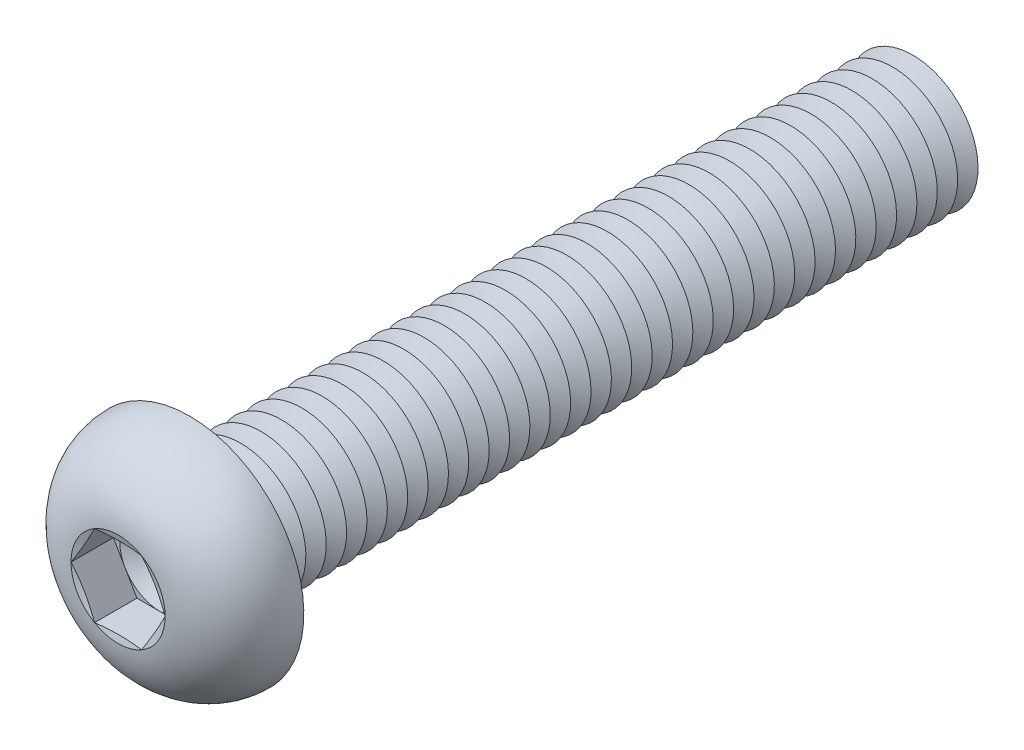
ISO-10303-21;
HEADER;
FILE_DESCRIPTION(('STEP AP214'),'2;1');
FILE_NAME('part.step','',(''),(''),'','','');
FILE_SCHEMA(('AUTOMOTIVE_DESIGN { 1 0 10303 214 1 1 1 1 }'));
ENDSEC;
DATA;
#1=APPLICATION_CONTEXT('core data for automotive mechanical design processes');
#2=APPLICATION_PROTOCOL_DEFINITION('international standard','automotive_design',2000,#1);
#3=PRODUCT_CONTEXT('',#1,'mechanical');
#4=PRODUCT('Part','Part','',(#3));
#5=PRODUCT_RELATED_PRODUCT_CATEGORY('part','',(#4));
#6=PRODUCT_DEFINITION_FORMATION('','',#4);
#7=PRODUCT_DEFINITION_CONTEXT('part definition',#1,'design');
#8=PRODUCT_DEFINITION('design','',#6,#7);
#9=PRODUCT_DEFINITION_SHAPE('','',#8);
#10=(LENGTH_UNIT() NAMED_UNIT(*) SI_UNIT(.MILLI.,.METRE.));
#11=(NAMED_UNIT(*) PLANE_ANGLE_UNIT() SI_UNIT($,.RADIAN.));
#12=(NAMED_UNIT(*) SI_UNIT($,.STERADIAN.) SOLID_ANGLE_UNIT());
#13=UNCERTAINTY_MEASURE_WITH_UNIT(LENGTH_MEASURE(1.E-05),#10,'distance_accuracy_value','');
#14=(GEOMETRIC_REPRESENTATION_CONTEXT(3) GLOBAL_UNCERTAINTY_ASSIGNED_CONTEXT((#13)) GLOBAL_UNIT_ASSIGNED_CONTEXT((#10,
#11,#12)) REPRESENTATION_CONTEXT('',''));
#15=CARTESIAN_POINT('',(0.,0.,0.));
#16=DIRECTION('',(0.,0.,1.));
#17=DIRECTION('',(1.,0.,0.));
#18=AXIS2_PLACEMENT_3D('',#15,#16,#17);
#19=CARTESIAN_POINT('',(0.,0.,1.8));
#20=DIRECTION('',(0.,0.,1.));
#21=DIRECTION('',(1.,0.,0.));
#22=AXIS2_PLACEMENT_3D('',#19,#20,#21);
#23=PLANE('',#22);
#24=CARTESIAN_POINT('',(0.,0.,1.8));
#25=DIRECTION('',(0.,0.,1.));
#26=DIRECTION('',(1.,0.,0.));
#27=AXIS2_PLACEMENT_3D('',#24,#25,#26);
#28=CIRCLE('',#27,2.49999883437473);
#29=CARTESIAN_POINT('',(2.1650625,1.24999941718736,1.8));
#30=VERTEX_POINT('',#29);
#31=CARTESIAN_POINT('',(0.,2.49999883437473,1.8));
#32=VERTEX_POINT('',#31);
#33=EDGE_CURVE('E118',#30,#32,#28,.T.);
#34=ORIENTED_EDGE('',*,*,#33,.F.);
#35=DIRECTION('',(-0.5,0.866025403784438,0.));
#36=VECTOR('',#35,1.);
#37=CARTESIAN_POINT('',(2.88675,0.,1.8));
#38=LINE('',#37,#36);
#39=CARTESIAN_POINT('',(1.443375,2.49999883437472,1.8));
#40=VERTEX_POINT('',#39);
#41=EDGE_CURVE('E125',#30,#40,#38,.T.);
#42=ORIENTED_EDGE('',*,*,#41,.T.);
#43=DIRECTION('',(-1.,0.,0.));
#44=VECTOR('',#43,1.);
#45=CARTESIAN_POINT('',(1.443375,2.49999883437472,1.8));
#46=LINE('',#45,#44);
#47=EDGE_CURVE('E136',#40,#32,#46,.T.);
#48=ORIENTED_EDGE('',*,*,#47,.T.);
#49=EDGE_LOOP('',(#34,#42,#48));
#50=FACE_BOUND('',#49,.T.);
#51=ADVANCED_FACE('F39',(#50),#23,.T.);
#52=CARTESIAN_POINT('',(0.,0.,1.8));
#53=DIRECTION('',(0.,0.,1.));
#54=DIRECTION('',(1.,0.,0.));
#55=AXIS2_PLACEMENT_3D('',#52,#53,#54);
#56=CIRCLE('',#55,2.49999883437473);
#57=CARTESIAN_POINT('',(-2.1650625,1.24999941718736,1.8));
#58=VERTEX_POINT('',#57);
#59=EDGE_CURVE('E11',#32,#58,#56,.T.);
#60=ORIENTED_EDGE('',*,*,#59,.F.);
#61=CARTESIAN_POINT('',(-1.443375,2.49999883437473,1.8));
#62=VERTEX_POINT('',#61);
#63=EDGE_CURVE('E131',#32,#62,#46,.T.);
#64=ORIENTED_EDGE('',*,*,#63,.T.);
#65=DIRECTION('',(-0.5,-0.866025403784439,0.));
#66=VECTOR('',#65,1.);
#67=CARTESIAN_POINT('',(-1.443375,2.49999883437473,1.8));
#68=LINE('',#67,#66);
#69=EDGE_CURVE('E134',#62,#58,#68,.T.);
#70=ORIENTED_EDGE('',*,*,#69,.T.);
#71=EDGE_LOOP('',(#60,#64,#70));
#72=FACE_BOUND('',#71,.T.);
#73=ADVANCED_FACE('F130',(#72),#23,.T.);
#74=CARTESIAN_POINT('',(-2.1650625,-1.24999941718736,1.8));
#75=VERTEX_POINT('',#74);
#76=EDGE_CURVE('E49',#58,#75,#56,.T.);
#77=ORIENTED_EDGE('',*,*,#76,.F.);
#78=CARTESIAN_POINT('',(-2.88675,0.,1.8));
#79=VERTEX_POINT('',#78);
#80=EDGE_CURVE('E143',#58,#79,#68,.T.);
#81=ORIENTED_EDGE('',*,*,#80,.T.);
#82=DIRECTION('',(0.5,-0.866025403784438,0.));
#83=VECTOR('',#82,1.);
#84=CARTESIAN_POINT('',(-2.88675,0.,1.8));
#85=LINE('',#84,#83);
#86=EDGE_CURVE('E152',#79,#75,#85,.T.);
#87=ORIENTED_EDGE('',*,*,#86,.T.);
#88=EDGE_LOOP('',(#77,#81,#87));
#89=FACE_BOUND('',#88,.T.);
#90=ADVANCED_FACE('F557',(#89),#23,.T.);
#91=CARTESIAN_POINT('',(0.,-2.49999883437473,1.8));
#92=VERTEX_POINT('',#91);
#93=EDGE_CURVE('E541',#75,#92,#56,.T.);
#94=ORIENTED_EDGE('',*,*,#93,.F.);
#95=CARTESIAN_POINT('',(-1.443375,-2.49999883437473,1.8));
#96=VERTEX_POINT('',#95);
#97=EDGE_CURVE('E151',#75,#96,#85,.T.);
#98=ORIENTED_EDGE('',*,*,#97,.T.);
#99=DIRECTION('',(1.,0.,0.));
#100=VECTOR('',#99,1.);
#101=CARTESIAN_POINT('',(-1.443375,-2.49999883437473,1.8));
#102=LINE('',#101,#100);
#103=EDGE_CURVE('E157',#96,#92,#102,.T.);
#104=ORIENTED_EDGE('',*,*,#103,.T.);
#105=EDGE_LOOP('',(#94,#98,#104));
#106=FACE_BOUND('',#105,.T.);
#107=ADVANCED_FACE('F550',(#106),#23,.T.);
#108=CARTESIAN_POINT('',(2.1650625,-1.24999941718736,1.8));
#109=VERTEX_POINT('',#108);
#110=EDGE_CURVE('E56',#92,#109,#56,.T.);
#111=ORIENTED_EDGE('',*,*,#110,.F.);
#112=CARTESIAN_POINT('',(1.443375,-2.49999883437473,1.8));
#113=VERTEX_POINT('',#112);
#114=EDGE_CURVE('E156',#92,#113,#102,.T.);
#115=ORIENTED_EDGE('',*,*,#114,.T.);
#116=DIRECTION('',(0.5,0.866025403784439,0.));
#117=VECTOR('',#116,1.);
#118=CARTESIAN_POINT('',(1.443375,-2.49999883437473,1.8));
#119=LINE('',#118,#117);
#120=EDGE_CURVE('E162',#113,#109,#119,.T.);
#121=ORIENTED_EDGE('',*,*,#120,.T.);
#122=EDGE_LOOP('',(#111,#115,#121));
#123=FACE_BOUND('',#122,.T.);
#124=ADVANCED_FACE('F625',(#123),#23,.T.);
#125=CARTESIAN_POINT('',(0.,0.,4.4));
#126=DIRECTION('',(0.,0.,1.));
#127=DIRECTION('',(0.,-1.,0.));
#128=AXIS2_PLACEMENT_3D('',#125,#126,#127);
#129=CONICAL_SURFACE('',#128,2.88675,1.30899693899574);
#130=CARTESIAN_POINT('',(2.88686547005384,-0.000200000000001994,4.40003094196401));
#131=CARTESIAN_POINT('',(2.82691617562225,0.103635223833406,4.3839595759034));
#132=CARTESIAN_POINT('',(2.76685817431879,0.20765873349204,4.36936933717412));
#133=CARTESIAN_POINT('',(2.64653003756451,0.416073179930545,4.3437355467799));
#134=CARTESIAN_POINT('',(2.58625982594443,0.520464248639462,4.33269343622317));
#135=CARTESIAN_POINT('',(2.46587274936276,0.72898078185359,4.31480063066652));
#136=CARTESIAN_POINT('',(2.40575669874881,0.833104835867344,4.3079285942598));
#137=CARTESIAN_POINT('',(2.28544792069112,1.04148575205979,4.29871388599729));
#138=CARTESIAN_POINT('',(2.22525521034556,1.14574258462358,4.29637033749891));
#139=CARTESIAN_POINT('',(2.10486978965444,1.35425624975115,4.29637033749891));
#140=CARTESIAN_POINT('',(2.04467707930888,1.45851308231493,4.29871388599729));
#141=CARTESIAN_POINT('',(1.92436830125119,1.66689399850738,4.3079285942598));
#142=CARTESIAN_POINT('',(1.86425225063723,1.77101805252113,4.31480063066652));
#143=CARTESIAN_POINT('',(1.74386517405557,1.97953458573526,4.33269343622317));
#144=CARTESIAN_POINT('',(1.68359496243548,2.08392565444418,4.3437355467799));
#145=CARTESIAN_POINT('',(1.56326682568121,2.29234010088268,4.36936933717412));
#146=CARTESIAN_POINT('',(1.50320882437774,2.39636361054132,4.3839595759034));
#147=CARTESIAN_POINT('',(1.44325952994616,2.50019883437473,4.40003094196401));
#148=B_SPLINE_CURVE_WITH_KNOTS('',3,(#130,#131,#132,#133,#134,#135,#136,#137,#138,#139,#140,
#141,#142,#143,#144,#145,#146,#147),.UNSPECIFIED.,.F.,.F.,(4,2,2,2,2,2,2,2,4),(0.,
0.362931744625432,0.726010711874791,1.08721550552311,1.44835036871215,1.80948523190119,
2.17069002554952,2.53376899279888,2.89670073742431),.UNSPECIFIED.);
#149=CARTESIAN_POINT('',(2.88675,0.,4.4));
#150=VERTEX_POINT('',#149);
#151=CARTESIAN_POINT('',(1.443375,2.49999883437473,4.4));
#152=VERTEX_POINT('',#151);
#153=EDGE_CURVE('E220',#150,#152,#148,.T.);
#154=ORIENTED_EDGE('',*,*,#153,.F.);
#155=CARTESIAN_POINT('',(0.,0.,4.4));
#156=DIRECTION('',(0.,0.,-1.));
#157=DIRECTION('',(0.,1.,0.));
#158=AXIS2_PLACEMENT_3D('',#155,#156,#157);
#159=CIRCLE('',#158,2.88675);
#160=EDGE_CURVE('E524',#152,#150,#159,.T.);
#161=ORIENTED_EDGE('',*,*,#160,.F.);
#162=EDGE_LOOP('',(#154,#161));
#163=FACE_BOUND('',#162,.T.);
#164=ADVANCED_FACE('F629',(#163),#129,.F.);
#165=CARTESIAN_POINT('',(1.44325952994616,-2.50019883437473,4.40003094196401));
#166=CARTESIAN_POINT('',(1.50320882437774,-2.39636361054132,4.3839595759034));
#167=CARTESIAN_POINT('',(1.56326682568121,-2.29234010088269,4.36936933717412));
#168=CARTESIAN_POINT('',(1.68359496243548,-2.08392565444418,4.3437355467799));
#169=CARTESIAN_POINT('',(1.74386517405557,-1.97953458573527,4.33269343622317));
#170=CARTESIAN_POINT('',(1.86425225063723,-1.77101805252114,4.31480063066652));
#171=CARTESIAN_POINT('',(1.92436830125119,-1.66689399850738,4.3079285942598));
#172=CARTESIAN_POINT('',(2.04467707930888,-1.45851308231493,4.29871388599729));
#173=CARTESIAN_POINT('',(2.10486978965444,-1.35425624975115,4.29637033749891));
#174=CARTESIAN_POINT('',(2.22525521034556,-1.14574258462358,4.29637033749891));
#175=CARTESIAN_POINT('',(2.28544792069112,-1.0414857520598,4.29871388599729));
#176=CARTESIAN_POINT('',(2.40575669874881,-0.833104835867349,4.3079285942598));
#177=CARTESIAN_POINT('',(2.46587274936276,-0.728980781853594,4.31480063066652));
#178=CARTESIAN_POINT('',(2.58625982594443,-0.520464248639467,4.33269343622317));
#179=CARTESIAN_POINT('',(2.64653003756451,-0.41607317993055,4.3437355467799));
#180=CARTESIAN_POINT('',(2.76685817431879,-0.207658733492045,4.36936933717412));
#181=CARTESIAN_POINT('',(2.82691617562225,-0.103635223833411,4.3839595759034));
#182=CARTESIAN_POINT('',(2.88686547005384,0.000199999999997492,4.40003094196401));
#183=B_SPLINE_CURVE_WITH_KNOTS('',3,(#165,#166,#167,#168,#169,#170,#171,#172,#173,#174,#175,
#176,#177,#178,#179,#180,#181,#182),.UNSPECIFIED.,.F.,.F.,(4,2,2,2,2,2,2,2,4),(0.,
0.362931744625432,0.726010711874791,1.08721550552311,1.44835036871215,1.80948523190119,
2.17069002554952,2.53376899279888,2.89670073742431),.UNSPECIFIED.);
#184=CARTESIAN_POINT('',(1.443375,-2.49999883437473,4.4));
#185=VERTEX_POINT('',#184);
#186=EDGE_CURVE('E229',#185,#150,#183,.T.);
#187=ORIENTED_EDGE('',*,*,#186,.F.);
#188=EDGE_CURVE('E529',#150,#185,#159,.T.);
#189=ORIENTED_EDGE('',*,*,#188,.F.);
#190=EDGE_LOOP('',(#187,#189));
#191=FACE_BOUND('',#190,.T.);
#192=ADVANCED_FACE('F591',(#191),#129,.F.);
#193=CARTESIAN_POINT('',(-4.35611719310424,-2.49999883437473,4.97227902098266));
#194=CARTESIAN_POINT('',(-4.25066509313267,-2.49999883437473,4.94777440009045));
#195=CARTESIAN_POINT('',(-4.14516541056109,-2.49999883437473,4.92347459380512));
#196=CARTESIAN_POINT('',(-3.93405094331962,-2.49999883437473,4.87537247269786));
#197=CARTESIAN_POINT('',(-3.82843615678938,-2.49999883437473,4.85157016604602));
#198=CARTESIAN_POINT('',(-3.5113534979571,-2.49999883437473,4.78103338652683));
#199=CARTESIAN_POINT('',(-3.29968815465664,-2.49999883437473,4.73517861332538));
#200=CARTESIAN_POINT('',(-2.87365524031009,-2.49999883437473,4.64645582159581));
#201=CARTESIAN_POINT('',(-2.65928093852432,-2.49999883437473,4.60361983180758));
#202=CARTESIAN_POINT('',(-2.22952626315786,-2.49999883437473,4.52311285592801));
#203=CARTESIAN_POINT('',(-2.01414580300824,-2.49999883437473,4.48544232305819));
#204=CARTESIAN_POINT('',(-1.58798319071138,-2.49999883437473,4.41876559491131));
#205=CARTESIAN_POINT('',(-1.37723418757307,-2.49999883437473,4.38955265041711));
#206=CARTESIAN_POINT('',(-0.954530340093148,-2.49999883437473,4.34171384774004));
#207=CARTESIAN_POINT('',(-0.742575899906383,-2.49999883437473,4.32308463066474));
#208=CARTESIAN_POINT('',(-0.424544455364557,-2.49999883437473,4.30539140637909));
#209=CARTESIAN_POINT('',(-0.318745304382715,-2.49999883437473,4.30120018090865));
#210=CARTESIAN_POINT('',(-0.107062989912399,-2.49999883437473,4.29638997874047));
#211=CARTESIAN_POINT('',(-0.00117982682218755,-2.49999883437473,4.29577098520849));
#212=CARTESIAN_POINT('',(0.210552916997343,-2.49999883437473,4.29814378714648));
#213=CARTESIAN_POINT('',(0.316402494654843,-2.49999883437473,4.30113585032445));
#214=CARTESIAN_POINT('',(0.527944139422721,-2.49999883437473,4.31057322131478));
#215=CARTESIAN_POINT('',(0.633636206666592,-2.49999883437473,4.31701852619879));
#216=CARTESIAN_POINT('',(0.890304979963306,-2.49999883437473,4.33652018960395));
#217=CARTESIAN_POINT('',(1.0411561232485,-2.49999883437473,4.35122885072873));
#218=CARTESIAN_POINT('',(1.34222474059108,-2.49999883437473,4.38593609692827));
#219=CARTESIAN_POINT('',(1.49244223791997,-2.49999883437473,4.40593448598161));
#220=CARTESIAN_POINT('',(1.79273634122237,-2.49999883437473,4.45011321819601));
#221=CARTESIAN_POINT('',(1.94281100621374,-2.49999883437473,4.47430656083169));
#222=CARTESIAN_POINT('',(2.24242097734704,-2.49999883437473,4.52583552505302));
#223=CARTESIAN_POINT('',(2.39195625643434,-2.49999883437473,4.55317130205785));
#224=CARTESIAN_POINT('',(2.69364402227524,-2.49999883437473,4.61079781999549));
#225=CARTESIAN_POINT('',(2.8457870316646,-2.49999883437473,4.64113779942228));
#226=CARTESIAN_POINT('',(3.14969016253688,-2.49999883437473,4.70367638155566));
#227=CARTESIAN_POINT('',(3.30145027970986,-2.49999883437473,4.73587500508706));
#228=CARTESIAN_POINT('',(3.60383766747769,-2.49999883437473,4.80150275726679));
#229=CARTESIAN_POINT('',(3.75446660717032,-2.49999883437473,4.83492423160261));
#230=CARTESIAN_POINT('',(4.05546753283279,-2.49999883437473,4.90285814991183));
#231=CARTESIAN_POINT('',(4.2058395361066,-2.49999883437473,4.9373705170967));
#232=CARTESIAN_POINT('',(4.35611719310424,-2.49999883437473,4.97227902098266));
#233=B_SPLINE_CURVE_WITH_KNOTS('',3,(#193,#194,#195,#196,#197,#198,#199,#200,#201,#202,#203,
#204,#205,#206,#207,#208,#209,#210,#211,#212,#213,#214,#215,#216,#217,#218,#219,#220,#221,#222,
#223,#224,#225,#226,#227,#228,#229,#230,#231,#232),.UNSPECIFIED.,.F.,.F.,(4,2,2,2,2,2,2,2,2,2,2,
2,2,2,2,2,2,2,2,4),(0.,0.324785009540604,0.6495753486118,1.29928181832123,1.95507889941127,
2.61093348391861,3.24905289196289,3.88696967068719,4.204563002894,4.5221548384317,
4.83977022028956,5.15738533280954,5.61196030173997,6.06651842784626,6.52251118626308,
6.97852650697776,7.44392737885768,7.90933346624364,8.37220553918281,8.83504510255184),.UNSPECIFIED.);
#234=CARTESIAN_POINT('',(-1.443375,-2.49999883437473,4.4));
#235=VERTEX_POINT('',#234);
#236=EDGE_CURVE('E571',#235,#185,#233,.T.);
#237=ORIENTED_EDGE('',*,*,#236,.F.);
#238=EDGE_CURVE('E583',#185,#235,#159,.T.);
#239=ORIENTED_EDGE('',*,*,#238,.F.);
#240=EDGE_LOOP('',(#237,#239));
#241=FACE_BOUND('',#240,.T.);
#242=ADVANCED_FACE('F596',(#241),#129,.F.);
#243=CARTESIAN_POINT('',(-2.88686547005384,0.000199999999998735,4.40003094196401));
#244=CARTESIAN_POINT('',(-2.82691617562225,-0.10363522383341,4.3839595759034));
#245=CARTESIAN_POINT('',(-2.76685817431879,-0.207658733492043,4.36936933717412));
#246=CARTESIAN_POINT('',(-2.64653003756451,-0.416073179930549,4.3437355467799));
#247=CARTESIAN_POINT('',(-2.58625982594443,-0.520464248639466,4.33269343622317));
#248=CARTESIAN_POINT('',(-2.46587274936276,-0.728980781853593,4.31480063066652));
#249=CARTESIAN_POINT('',(-2.40575669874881,-0.833104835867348,4.3079285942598));
#250=CARTESIAN_POINT('',(-2.28544792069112,-1.0414857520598,4.29871388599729));
#251=CARTESIAN_POINT('',(-2.22525521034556,-1.14574258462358,4.29637033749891));
#252=CARTESIAN_POINT('',(-2.10486978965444,-1.35425624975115,4.29637033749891));
#253=CARTESIAN_POINT('',(-2.04467707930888,-1.45851308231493,4.29871388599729));
#254=CARTESIAN_POINT('',(-1.92436830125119,-1.66689399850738,4.3079285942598));
#255=CARTESIAN_POINT('',(-1.86425225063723,-1.77101805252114,4.31480063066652));
#256=CARTESIAN_POINT('',(-1.74386517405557,-1.97953458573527,4.33269343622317));
#257=CARTESIAN_POINT('',(-1.68359496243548,-2.08392565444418,4.3437355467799));
#258=CARTESIAN_POINT('',(-1.56326682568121,-2.29234010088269,4.36936933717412));
#259=CARTESIAN_POINT('',(-1.50320882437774,-2.39636361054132,4.3839595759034));
#260=CARTESIAN_POINT('',(-1.44325952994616,-2.50019883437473,4.40003094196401));
#261=B_SPLINE_CURVE_WITH_KNOTS('',3,(#243,#244,#245,#246,#247,#248,#249,#250,#251,#252,#253,
#254,#255,#256,#257,#258,#259,#260),.UNSPECIFIED.,.F.,.F.,(4,2,2,2,2,2,2,2,4),(0.,
0.362931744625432,0.726010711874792,1.08721550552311,1.44835036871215,1.8094852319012,
2.17069002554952,2.53376899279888,2.89670073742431),.UNSPECIFIED.);
#262=CARTESIAN_POINT('',(-2.88675,0.,4.4));
#263=VERTEX_POINT('',#262);
#264=EDGE_CURVE('E562',#263,#235,#261,.T.);
#265=ORIENTED_EDGE('',*,*,#264,.F.);
#266=EDGE_CURVE('E568',#235,#263,#159,.T.);
#267=ORIENTED_EDGE('',*,*,#266,.F.);
#268=EDGE_LOOP('',(#265,#267));
#269=FACE_BOUND('',#268,.T.);
#270=ADVANCED_FACE('F566',(#269),#129,.F.);
#271=CARTESIAN_POINT('',(-1.44325952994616,2.50019883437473,4.40003094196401));
#272=CARTESIAN_POINT('',(-1.50320882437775,2.39636361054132,4.3839595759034));
#273=CARTESIAN_POINT('',(-1.56326682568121,2.29234010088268,4.36936933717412));
#274=CARTESIAN_POINT('',(-1.68359496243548,2.08392565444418,4.3437355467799));
#275=CARTESIAN_POINT('',(-1.74386517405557,1.97953458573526,4.33269343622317));
#276=CARTESIAN_POINT('',(-1.86425225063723,1.77101805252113,4.31480063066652));
#277=CARTESIAN_POINT('',(-1.92436830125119,1.66689399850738,4.3079285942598));
#278=CARTESIAN_POINT('',(-2.04467707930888,1.45851308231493,4.29871388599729));
#279=CARTESIAN_POINT('',(-2.10486978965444,1.35425624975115,4.29637033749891));
#280=CARTESIAN_POINT('',(-2.22525521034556,1.14574258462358,4.29637033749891));
#281=CARTESIAN_POINT('',(-2.28544792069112,1.04148575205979,4.29871388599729));
#282=CARTESIAN_POINT('',(-2.40575669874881,0.833104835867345,4.3079285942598));
#283=CARTESIAN_POINT('',(-2.46587274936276,0.728980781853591,4.31480063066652));
#284=CARTESIAN_POINT('',(-2.58625982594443,0.520464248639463,4.33269343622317));
#285=CARTESIAN_POINT('',(-2.64653003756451,0.416073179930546,4.3437355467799));
#286=CARTESIAN_POINT('',(-2.76685817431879,0.207658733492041,4.36936933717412));
#287=CARTESIAN_POINT('',(-2.82691617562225,0.103635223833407,4.3839595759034));
#288=CARTESIAN_POINT('',(-2.88686547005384,-0.000200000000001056,4.40003094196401));
#289=B_SPLINE_CURVE_WITH_KNOTS('',3,(#271,#272,#273,#274,#275,#276,#277,#278,#279,#280,#281,
#282,#283,#284,#285,#286,#287,#288),.UNSPECIFIED.,.F.,.F.,(4,2,2,2,2,2,2,2,4),(0.,
0.362931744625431,0.72601071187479,1.08721550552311,1.44835036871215,1.80948523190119,
2.17069002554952,2.53376899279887,2.89670073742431),.UNSPECIFIED.);
#290=CARTESIAN_POINT('',(-1.443375,2.49999883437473,4.4));
#291=VERTEX_POINT('',#290);
#292=EDGE_CURVE('E194',#291,#263,#289,.T.);
#293=ORIENTED_EDGE('',*,*,#292,.F.);
#294=EDGE_CURVE('E574',#263,#291,#159,.T.);
#295=ORIENTED_EDGE('',*,*,#294,.F.);
#296=EDGE_LOOP('',(#293,#295));
#297=FACE_BOUND('',#296,.T.);
#298=ADVANCED_FACE('F575',(#297),#129,.F.);
#299=CARTESIAN_POINT('',(0.,0.,-40.625));
#300=DIRECTION('',(0.,0.,1.));
#301=DIRECTION('',(0.,-1.,0.));
#302=AXIS2_PLACEMENT_3D('',#299,#300,#301);
#303=CONICAL_SURFACE('',#302,3.99999999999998,1.0471975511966);
#304=CARTESIAN_POINT('',(0.,0.,-41.25));
#305=DIRECTION('',(0.,0.,1.));
#306=DIRECTION('',(0.,-1.,0.));
#307=AXIS2_PLACEMENT_3D('',#304,#305,#306);
#308=CIRCLE('',#307,2.91746824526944);
#309=CARTESIAN_POINT('',(0.,-2.91746824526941,-41.25));
#310=VERTEX_POINT('',#309);
#311=EDGE_CURVE('E495',#310,#310,#308,.T.);
#312=ORIENTED_EDGE('',*,*,#311,.T.);
#313=EDGE_LOOP('',(#312));
#314=FACE_BOUND('',#313,.T.);
#315=CARTESIAN_POINT('',(0.,0.,-40.625));
#316=DIRECTION('',(0.,0.,1.));
#317=DIRECTION('',(0.,-1.,0.));
#318=AXIS2_PLACEMENT_3D('',#315,#316,#317);
#319=CIRCLE('',#318,3.99999999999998);
#320=CARTESIAN_POINT('',(0.,-3.99999999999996,-40.625));
#321=VERTEX_POINT('',#320);
#322=EDGE_CURVE('E491',#321,#321,#319,.T.);
#323=ORIENTED_EDGE('',*,*,#322,.F.);
#324=EDGE_LOOP('',(#323));
#325=FACE_BOUND('',#324,.T.);
#326=ADVANCED_FACE('F657',(#314,#325),#303,.T.);
#327=CARTESIAN_POINT('',(0.,0.,-41.25));
#328=DIRECTION('',(0.,0.,-1.));
#329=DIRECTION('',(0.,1.,0.));
#330=AXIS2_PLACEMENT_3D('',#327,#328,#329);
#331=CONICAL_SURFACE('',#330,2.91746824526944,1.0471975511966);
#332=CARTESIAN_POINT('',(0.,0.,-41.875));
#333=DIRECTION('',(0.,0.,1.));
#334=DIRECTION('',(0.,-1.,0.));
#335=AXIS2_PLACEMENT_3D('',#332,#333,#334);
#336=CIRCLE('',#335,3.99999999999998);
#337=CARTESIAN_POINT('',(0.,-3.99999999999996,-41.875));
#338=VERTEX_POINT('',#337);
#339=EDGE_CURVE('E499',#338,#338,#336,.T.);
#340=ORIENTED_EDGE('',*,*,#339,.T.);
#341=EDGE_LOOP('',(#340));
#342=FACE_BOUND('',#341,.T.);
#343=ORIENTED_EDGE('',*,*,#311,.F.);
#344=EDGE_LOOP('',(#343));
#345=FACE_BOUND('',#344,.T.);
#346=ADVANCED_FACE('F662',(#342,#345),#331,.T.);
#347=CARTESIAN_POINT('',(0.,3.99999999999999,-45.));
#348=DIRECTION('',(0.,0.,-1.));
#349=DIRECTION('',(0.,1.,0.));
#350=AXIS2_PLACEMENT_3D('',#347,#348,#349);
#351=PLANE('',#350);
#352=CARTESIAN_POINT('',(0.,0.,-45.));
#353=DIRECTION('',(0.,0.,1.));
#354=DIRECTION('',(0.,-1.,0.));
#355=AXIS2_PLACEMENT_3D('',#352,#353,#354);
#356=CIRCLE('',#355,2.91746824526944);
#357=CARTESIAN_POINT('',(0.,-2.91746824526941,-45.));
#358=VERTEX_POINT('',#357);
#359=EDGE_CURVE('E519',#358,#358,#356,.T.);
#360=ORIENTED_EDGE('',*,*,#359,.F.);
#361=EDGE_LOOP('',(#360));
#362=FACE_BOUND('',#361,.T.);
#363=ADVANCED_FACE('F829',(#362),#351,.T.);
#364=CARTESIAN_POINT('',(0.,0.,-44.375));
#365=DIRECTION('',(0.,0.,1.));
#366=DIRECTION('',(0.,-1.,0.));
#367=AXIS2_PLACEMENT_3D('',#364,#365,#366);
#368=CONICAL_SURFACE('',#367,3.99999999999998,1.0471975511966);
#369=ORIENTED_EDGE('',*,*,#359,.T.);
#370=EDGE_LOOP('',(#369));
#371=FACE_BOUND('',#370,.T.);
#372=CARTESIAN_POINT('',(0.,0.,-44.375));
#373=DIRECTION('',(0.,0.,1.));
#374=DIRECTION('',(0.,-1.,0.));
#375=AXIS2_PLACEMENT_3D('',#372,#373,#374);
#376=CIRCLE('',#375,3.99999999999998);
#377=CARTESIAN_POINT('',(0.,-3.99999999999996,-44.375));
#378=VERTEX_POINT('',#377);
#379=EDGE_CURVE('E515',#378,#378,#376,.T.);
#380=ORIENTED_EDGE('',*,*,#379,.F.);
#381=EDGE_LOOP('',(#380));
#382=FACE_BOUND('',#381,.T.);
#383=ADVANCED_FACE('F822',(#371,#382),#368,.T.);
#384=CARTESIAN_POINT('',(0.,0.,-43.75));
#385=DIRECTION('',(0.,0.,-1.));
#386=DIRECTION('',(0.,1.,0.));
#387=AXIS2_PLACEMENT_3D('',#384,#385,#386);
#388=CONICAL_SURFACE('',#387,2.91746824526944,1.0471975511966);
#389=ORIENTED_EDGE('',*,*,#379,.T.);
#390=EDGE_LOOP('',(#389));
#391=FACE_BOUND('',#390,.T.);
#392=CARTESIAN_POINT('',(0.,0.,-43.75));
#393=DIRECTION('',(0.,0.,1.));
#394=DIRECTION('',(0.,-1.,0.));
#395=AXIS2_PLACEMENT_3D('',#392,#393,#394);
#396=CIRCLE('',#395,2.91746824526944);
#397=CARTESIAN_POINT('',(0.,-2.91746824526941,-43.75));
#398=VERTEX_POINT('',#397);
#399=EDGE_CURVE('E511',#398,#398,#396,.T.);
#400=ORIENTED_EDGE('',*,*,#399,.F.);
#401=EDGE_LOOP('',(#400));
#402=FACE_BOUND('',#401,.T.);
#403=ADVANCED_FACE('F828',(#391,#402),#388,.T.);
#404=CARTESIAN_POINT('',(0.,0.,-43.125));
#405=DIRECTION('',(0.,0.,1.));
#406=DIRECTION('',(0.,-1.,0.));
#407=AXIS2_PLACEMENT_3D('',#404,#405,#406);
#408=CONICAL_SURFACE('',#407,3.99999999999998,1.0471975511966);
#409=ORIENTED_EDGE('',*,*,#399,.T.);
#410=EDGE_LOOP('',(#409));
#411=FACE_BOUND('',#410,.T.);
#412=CARTESIAN_POINT('',(0.,0.,-43.125));
#413=DIRECTION('',(0.,0.,1.));
#414=DIRECTION('',(0.,-1.,0.));
#415=AXIS2_PLACEMENT_3D('',#412,#413,#414);
#416=CIRCLE('',#415,3.99999999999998);
#417=CARTESIAN_POINT('',(0.,-3.99999999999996,-43.125));
#418=VERTEX_POINT('',#417);
#419=EDGE_CURVE('E507',#418,#418,#416,.T.);
#420=ORIENTED_EDGE('',*,*,#419,.F.);
#421=EDGE_LOOP('',(#420));
#422=FACE_BOUND('',#421,.T.);
#423=ADVANCED_FACE('F860',(#411,#422),#408,.T.);
#424=CARTESIAN_POINT('',(0.,0.,-42.5));
#425=DIRECTION('',(0.,0.,-1.));
#426=DIRECTION('',(0.,1.,0.));
#427=AXIS2_PLACEMENT_3D('',#424,#425,#426);
#428=CONICAL_SURFACE('',#427,2.91746824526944,1.0471975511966);
#429=ORIENTED_EDGE('',*,*,#419,.T.);
#430=EDGE_LOOP('',(#429));
#431=FACE_BOUND('',#430,.T.);
#432=CARTESIAN_POINT('',(0.,0.,-42.5));
#433=DIRECTION('',(0.,0.,1.));
#434=DIRECTION('',(0.,-1.,0.));
#435=AXIS2_PLACEMENT_3D('',#432,#433,#434);
#436=CIRCLE('',#435,2.91746824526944);
#437=CARTESIAN_POINT('',(0.,-2.91746824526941,-42.5));
#438=VERTEX_POINT('',#437);
#439=EDGE_CURVE('E503',#438,#438,#436,.T.);
#440=ORIENTED_EDGE('',*,*,#439,.F.);
#441=EDGE_LOOP('',(#440));
#442=FACE_BOUND('',#441,.T.);
#443=ADVANCED_FACE('F870',(#431,#442),#428,.T.);
#444=CARTESIAN_POINT('',(0.,0.,-41.875));
#445=DIRECTION('',(0.,0.,1.));
#446=DIRECTION('',(0.,-1.,0.));
#447=AXIS2_PLACEMENT_3D('',#444,#445,#446);
#448=CONICAL_SURFACE('',#447,3.99999999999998,1.0471975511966);
#449=ORIENTED_EDGE('',*,*,#439,.T.);
#450=EDGE_LOOP('',(#449));
#451=FACE_BOUND('',#450,.T.);
#452=ORIENTED_EDGE('',*,*,#339,.F.);
#453=EDGE_LOOP('',(#452));
#454=FACE_BOUND('',#453,.T.);
#455=ADVANCED_FACE('F880',(#451,#454),#448,.T.);
#456=CARTESIAN_POINT('',(0.,0.,-39.375));
#457=DIRECTION('',(0.,0.,1.));
#458=DIRECTION('',(0.,-1.,0.));
#459=AXIS2_PLACEMENT_3D('',#456,#457,#458);
#460=CONICAL_SURFACE('',#459,3.99999999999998,1.0471975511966);
#461=CARTESIAN_POINT('',(0.,0.,-40.));
#462=DIRECTION('',(0.,0.,1.));
#463=DIRECTION('',(0.,-1.,0.));
#464=AXIS2_PLACEMENT_3D('',#461,#462,#463);
#465=CIRCLE('',#464,2.91746824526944);
#466=CARTESIAN_POINT('',(0.,-2.91746824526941,-40.));
#467=VERTEX_POINT('',#466);
#468=EDGE_CURVE('E487',#467,#467,#465,.T.);
#469=ORIENTED_EDGE('',*,*,#468,.T.);
#470=EDGE_LOOP('',(#469));
#471=FACE_BOUND('',#470,.T.);
#472=CARTESIAN_POINT('',(0.,0.,-39.375));
#473=DIRECTION('',(0.,0.,1.));
#474=DIRECTION('',(0.,-1.,0.));
#475=AXIS2_PLACEMENT_3D('',#472,#473,#474);
#476=CIRCLE('',#475,3.99999999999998);
#477=CARTESIAN_POINT('',(0.,-3.99999999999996,-39.375));
#478=VERTEX_POINT('',#477);
#479=EDGE_CURVE('E483',#478,#478,#476,.T.);
#480=ORIENTED_EDGE('',*,*,#479,.F.);
#481=EDGE_LOOP('',(#480));
#482=FACE_BOUND('',#481,.T.);
#483=ADVANCED_FACE('F890',(#471,#482),#460,.T.);
#484=CARTESIAN_POINT('',(0.,0.,-40.));
#485=DIRECTION('',(0.,0.,-1.));
#486=DIRECTION('',(0.,1.,0.));
#487=AXIS2_PLACEMENT_3D('',#484,#485,#486);
#488=CONICAL_SURFACE('',#487,2.91746824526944,1.0471975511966);
#489=ORIENTED_EDGE('',*,*,#322,.T.);
#490=EDGE_LOOP('',(#489));
#491=FACE_BOUND('',#490,.T.);
#492=ORIENTED_EDGE('',*,*,#468,.F.);
#493=EDGE_LOOP('',(#492));
#494=FACE_BOUND('',#493,.T.);
#495=ADVANCED_FACE('F900',(#491,#494),#488,.T.);
#496=CARTESIAN_POINT('',(0.,0.,-38.125));
#497=DIRECTION('',(0.,0.,1.));
#498=DIRECTION('',(0.,-1.,0.));
#499=AXIS2_PLACEMENT_3D('',#496,#497,#498);
#500=CONICAL_SURFACE('',#499,3.99999999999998,1.0471975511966);
#501=CARTESIAN_POINT('',(0.,0.,-38.75));
#502=DIRECTION('',(0.,0.,1.));
#503=DIRECTION('',(0.,-1.,0.));
#504=AXIS2_PLACEMENT_3D('',#501,#502,#503);
#505=CIRCLE('',#504,2.91746824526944);
#506=CARTESIAN_POINT('',(0.,-2.91746824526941,-38.75));
#507=VERTEX_POINT('',#506);
#508=EDGE_CURVE('E479',#507,#507,#505,.T.);
#509=ORIENTED_EDGE('',*,*,#508,.T.);
#510=EDGE_LOOP('',(#509));
#511=FACE_BOUND('',#510,.T.);
#512=CARTESIAN_POINT('',(0.,0.,-38.125));
#513=DIRECTION('',(0.,0.,1.));
#514=DIRECTION('',(0.,-1.,0.));
#515=AXIS2_PLACEMENT_3D('',#512,#513,#514);
#516=CIRCLE('',#515,3.99999999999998);
#517=CARTESIAN_POINT('',(0.,-3.99999999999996,-38.125));
#518=VERTEX_POINT('',#517);
#519=EDGE_CURVE('E475',#518,#518,#516,.T.);
#520=ORIENTED_EDGE('',*,*,#519,.F.);
#521=EDGE_LOOP('',(#520));
#522=FACE_BOUND('',#521,.T.);
#523=ADVANCED_FACE('F910',(#511,#522),#500,.T.);
#524=CARTESIAN_POINT('',(0.,0.,-38.75));
#525=DIRECTION('',(0.,0.,-1.));
#526=DIRECTION('',(0.,1.,0.));
#527=AXIS2_PLACEMENT_3D('',#524,#525,#526);
#528=CONICAL_SURFACE('',#527,2.91746824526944,1.0471975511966);
#529=ORIENTED_EDGE('',*,*,#479,.T.);
#530=EDGE_LOOP('',(#529));
#531=FACE_BOUND('',#530,.T.);
#532=ORIENTED_EDGE('',*,*,#508,.F.);
#533=EDGE_LOOP('',(#532));
#534=FACE_BOUND('',#533,.T.);
#535=ADVANCED_FACE('F920',(#531,#534),#528,.T.);
#536=CARTESIAN_POINT('',(0.,0.,-36.875));
#537=DIRECTION('',(0.,0.,1.));
#538=DIRECTION('',(0.,-1.,0.));
#539=AXIS2_PLACEMENT_3D('',#536,#537,#538);
#540=CONICAL_SURFACE('',#539,3.99999999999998,1.0471975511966);
#541=CARTESIAN_POINT('',(0.,0.,-37.5));
#542=DIRECTION('',(0.,0.,1.));
#543=DIRECTION('',(0.,-1.,0.));
#544=AXIS2_PLACEMENT_3D('',#541,#542,#543);
#545=CIRCLE('',#544,2.91746824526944);
#546=CARTESIAN_POINT('',(0.,-2.91746824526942,-37.5));
#547=VERTEX_POINT('',#546);
#548=EDGE_CURVE('E471',#547,#547,#545,.T.);
#549=ORIENTED_EDGE('',*,*,#548,.T.);
#550=EDGE_LOOP('',(#549));
#551=FACE_BOUND('',#550,.T.);
#552=CARTESIAN_POINT('',(0.,0.,-36.875));
#553=DIRECTION('',(0.,0.,1.));
#554=DIRECTION('',(0.,-1.,0.));
#555=AXIS2_PLACEMENT_3D('',#552,#553,#554);
#556=CIRCLE('',#555,3.99999999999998);
#557=CARTESIAN_POINT('',(0.,-3.99999999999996,-36.875));
#558=VERTEX_POINT('',#557);
#559=EDGE_CURVE('E467',#558,#558,#556,.T.);
#560=ORIENTED_EDGE('',*,*,#559,.F.);
#561=EDGE_LOOP('',(#560));
#562=FACE_BOUND('',#561,.T.);
#563=ADVANCED_FACE('F930',(#551,#562),#540,.T.);
#564=CARTESIAN_POINT('',(0.,0.,-37.5));
#565=DIRECTION('',(0.,0.,-1.));
#566=DIRECTION('',(0.,1.,0.));
#567=AXIS2_PLACEMENT_3D('',#564,#565,#566);
#568=CONICAL_SURFACE('',#567,2.91746824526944,1.0471975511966);
#569=ORIENTED_EDGE('',*,*,#519,.T.);
#570=EDGE_LOOP('',(#569));
#571=FACE_BOUND('',#570,.T.);
#572=ORIENTED_EDGE('',*,*,#548,.F.);
#573=EDGE_LOOP('',(#572));
#574=FACE_BOUND('',#573,.T.);
#575=ADVANCED_FACE('F940',(#571,#574),#568,.T.);
#576=CARTESIAN_POINT('',(0.,0.,-35.625));
#577=DIRECTION('',(0.,0.,1.));
#578=DIRECTION('',(0.,-1.,0.));
#579=AXIS2_PLACEMENT_3D('',#576,#577,#578);
#580=CONICAL_SURFACE('',#579,3.99999999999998,1.0471975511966);
#581=CARTESIAN_POINT('',(0.,0.,-36.25));
#582=DIRECTION('',(0.,0.,1.));
#583=DIRECTION('',(0.,-1.,0.));
#584=AXIS2_PLACEMENT_3D('',#581,#582,#583);
#585=CIRCLE('',#584,2.91746824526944);
#586=CARTESIAN_POINT('',(0.,-2.91746824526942,-36.25));
#587=VERTEX_POINT('',#586);
#588=EDGE_CURVE('E463',#587,#587,#585,.T.);
#589=ORIENTED_EDGE('',*,*,#588,.T.);
#590=EDGE_LOOP('',(#589));
#591=FACE_BOUND('',#590,.T.);
#592=CARTESIAN_POINT('',(0.,0.,-35.625));
#593=DIRECTION('',(0.,0.,1.));
#594=DIRECTION('',(0.,-1.,0.));
#595=AXIS2_PLACEMENT_3D('',#592,#593,#594);
#596=CIRCLE('',#595,3.99999999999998);
#597=CARTESIAN_POINT('',(0.,-3.99999999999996,-35.625));
#598=VERTEX_POINT('',#597);
#599=EDGE_CURVE('E459',#598,#598,#596,.T.);
#600=ORIENTED_EDGE('',*,*,#599,.F.);
#601=EDGE_LOOP('',(#600));
#602=FACE_BOUND('',#601,.T.);
#603=ADVANCED_FACE('F950',(#591,#602),#580,.T.);
#604=CARTESIAN_POINT('',(0.,0.,-36.25));
#605=DIRECTION('',(0.,0.,-1.));
#606=DIRECTION('',(0.,1.,0.));
#607=AXIS2_PLACEMENT_3D('',#604,#605,#606);
#608=CONICAL_SURFACE('',#607,2.91746824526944,1.0471975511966);
#609=ORIENTED_EDGE('',*,*,#559,.T.);
#610=EDGE_LOOP('',(#609));
#611=FACE_BOUND('',#610,.T.);
#612=ORIENTED_EDGE('',*,*,#588,.F.);
#613=EDGE_LOOP('',(#612));
#614=FACE_BOUND('',#613,.T.);
#615=ADVANCED_FACE('F960',(#611,#614),#608,.T.);
#616=CARTESIAN_POINT('',(0.,0.,-34.375));
#617=DIRECTION('',(0.,0.,1.));
#618=DIRECTION('',(0.,-1.,0.));
#619=AXIS2_PLACEMENT_3D('',#616,#617,#618);
#620=CONICAL_SURFACE('',#619,3.99999999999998,1.0471975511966);
#621=CARTESIAN_POINT('',(0.,0.,-35.));
#622=DIRECTION('',(0.,0.,1.));
#623=DIRECTION('',(0.,-1.,0.));
#624=AXIS2_PLACEMENT_3D('',#621,#622,#623);
#625=CIRCLE('',#624,2.91746824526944);
#626=CARTESIAN_POINT('',(0.,-2.91746824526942,-35.));
#627=VERTEX_POINT('',#626);
#628=EDGE_CURVE('E455',#627,#627,#625,.T.);
#629=ORIENTED_EDGE('',*,*,#628,.T.);
#630=EDGE_LOOP('',(#629));
#631=FACE_BOUND('',#630,.T.);
#632=CARTESIAN_POINT('',(0.,0.,-34.375));
#633=DIRECTION('',(0.,0.,1.));
#634=DIRECTION('',(0.,-1.,0.));
#635=AXIS2_PLACEMENT_3D('',#632,#633,#634);
#636=CIRCLE('',#635,3.99999999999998);
#637=CARTESIAN_POINT('',(0.,-3.99999999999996,-34.375));
#638=VERTEX_POINT('',#637);
#639=EDGE_CURVE('E451',#638,#638,#636,.T.);
#640=ORIENTED_EDGE('',*,*,#639,.F.);
#641=EDGE_LOOP('',(#640));
#642=FACE_BOUND('',#641,.T.);
#643=ADVANCED_FACE('F970',(#631,#642),#620,.T.);
#644=CARTESIAN_POINT('',(0.,0.,-35.));
#645=DIRECTION('',(0.,0.,-1.));
#646=DIRECTION('',(0.,1.,0.));
#647=AXIS2_PLACEMENT_3D('',#644,#645,#646);
#648=CONICAL_SURFACE('',#647,2.91746824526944,1.0471975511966);
#649=ORIENTED_EDGE('',*,*,#599,.T.);
#650=EDGE_LOOP('',(#649));
#651=FACE_BOUND('',#650,.T.);
#652=ORIENTED_EDGE('',*,*,#628,.F.);
#653=EDGE_LOOP('',(#652));
#654=FACE_BOUND('',#653,.T.);
#655=ADVANCED_FACE('F980',(#651,#654),#648,.T.);
#656=CARTESIAN_POINT('',(0.,0.,-33.125));
#657=DIRECTION('',(0.,0.,1.));
#658=DIRECTION('',(0.,-1.,0.));
#659=AXIS2_PLACEMENT_3D('',#656,#657,#658);
#660=CONICAL_SURFACE('',#659,3.99999999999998,1.0471975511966);
#661=CARTESIAN_POINT('',(0.,0.,-33.75));
#662=DIRECTION('',(0.,0.,1.));
#663=DIRECTION('',(0.,-1.,0.));
#664=AXIS2_PLACEMENT_3D('',#661,#662,#663);
#665=CIRCLE('',#664,2.91746824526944);
#666=CARTESIAN_POINT('',(0.,-2.91746824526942,-33.75));
#667=VERTEX_POINT('',#666);
#668=EDGE_CURVE('E447',#667,#667,#665,.T.);
#669=ORIENTED_EDGE('',*,*,#668,.T.);
#670=EDGE_LOOP('',(#669));
#671=FACE_BOUND('',#670,.T.);
#672=CARTESIAN_POINT('',(0.,0.,-33.125));
#673=DIRECTION('',(0.,0.,1.));
#674=DIRECTION('',(0.,-1.,0.));
#675=AXIS2_PLACEMENT_3D('',#672,#673,#674);
#676=CIRCLE('',#675,3.99999999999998);
#677=CARTESIAN_POINT('',(0.,-3.99999999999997,-33.125));
#678=VERTEX_POINT('',#677);
#679=EDGE_CURVE('E443',#678,#678,#676,.T.);
#680=ORIENTED_EDGE('',*,*,#679,.F.);
#681=EDGE_LOOP('',(#680));
#682=FACE_BOUND('',#681,.T.);
#683=ADVANCED_FACE('F990',(#671,#682),#660,.T.);
#684=CARTESIAN_POINT('',(0.,0.,-33.75));
#685=DIRECTION('',(0.,0.,-1.));
#686=DIRECTION('',(0.,1.,0.));
#687=AXIS2_PLACEMENT_3D('',#684,#685,#686);
#688=CONICAL_SURFACE('',#687,2.91746824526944,1.0471975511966);
#689=ORIENTED_EDGE('',*,*,#639,.T.);
#690=EDGE_LOOP('',(#689));
#691=FACE_BOUND('',#690,.T.);
#692=ORIENTED_EDGE('',*,*,#668,.F.);
#693=EDGE_LOOP('',(#692));
#694=FACE_BOUND('',#693,.T.);
#695=ADVANCED_FACE('F1000',(#691,#694),#688,.T.);
#696=CARTESIAN_POINT('',(0.,0.,-31.875));
#697=DIRECTION('',(0.,0.,1.));
#698=DIRECTION('',(0.,-1.,0.));
#699=AXIS2_PLACEMENT_3D('',#696,#697,#698);
#700=CONICAL_SURFACE('',#699,3.99999999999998,1.0471975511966);
#701=CARTESIAN_POINT('',(0.,0.,-32.5));
#702=DIRECTION('',(0.,0.,1.));
#703=DIRECTION('',(0.,-1.,0.));
#704=AXIS2_PLACEMENT_3D('',#701,#702,#703);
#705=CIRCLE('',#704,2.91746824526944);
#706=CARTESIAN_POINT('',(0.,-2.91746824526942,-32.5));
#707=VERTEX_POINT('',#706);
#708=EDGE_CURVE('E439',#707,#707,#705,.T.);
#709=ORIENTED_EDGE('',*,*,#708,.T.);
#710=EDGE_LOOP('',(#709));
#711=FACE_BOUND('',#710,.T.);
#712=CARTESIAN_POINT('',(0.,0.,-31.875));
#713=DIRECTION('',(0.,0.,1.));
#714=DIRECTION('',(0.,-1.,0.));
#715=AXIS2_PLACEMENT_3D('',#712,#713,#714);
#716=CIRCLE('',#715,3.99999999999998);
#717=CARTESIAN_POINT('',(0.,-3.99999999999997,-31.875));
#718=VERTEX_POINT('',#717);
#719=EDGE_CURVE('E435',#718,#718,#716,.T.);
#720=ORIENTED_EDGE('',*,*,#719,.F.);
#721=EDGE_LOOP('',(#720));
#722=FACE_BOUND('',#721,.T.);
#723=ADVANCED_FACE('F1010',(#711,#722),#700,.T.);
#724=CARTESIAN_POINT('',(0.,0.,-32.5));
#725=DIRECTION('',(0.,0.,-1.));
#726=DIRECTION('',(0.,1.,0.));
#727=AXIS2_PLACEMENT_3D('',#724,#725,#726);
#728=CONICAL_SURFACE('',#727,2.91746824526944,1.0471975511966);
#729=ORIENTED_EDGE('',*,*,#679,.T.);
#730=EDGE_LOOP('',(#729));
#731=FACE_BOUND('',#730,.T.);
#732=ORIENTED_EDGE('',*,*,#708,.F.);
#733=EDGE_LOOP('',(#732));
#734=FACE_BOUND('',#733,.T.);
#735=ADVANCED_FACE('F1020',(#731,#734),#728,.T.);
#736=CARTESIAN_POINT('',(0.,0.,-30.625));
#737=DIRECTION('',(0.,0.,1.));
#738=DIRECTION('',(0.,-1.,0.));
#739=AXIS2_PLACEMENT_3D('',#736,#737,#738);
#740=CONICAL_SURFACE('',#739,3.99999999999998,1.0471975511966);
#741=CARTESIAN_POINT('',(0.,0.,-31.25));
#742=DIRECTION('',(0.,0.,1.));
#743=DIRECTION('',(0.,-1.,0.));
#744=AXIS2_PLACEMENT_3D('',#741,#742,#743);
#745=CIRCLE('',#744,2.91746824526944);
#746=CARTESIAN_POINT('',(0.,-2.91746824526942,-31.25));
#747=VERTEX_POINT('',#746);
#748=EDGE_CURVE('E431',#747,#747,#745,.T.);
#749=ORIENTED_EDGE('',*,*,#748,.T.);
#750=EDGE_LOOP('',(#749));
#751=FACE_BOUND('',#750,.T.);
#752=CARTESIAN_POINT('',(0.,0.,-30.625));
#753=DIRECTION('',(0.,0.,1.));
#754=DIRECTION('',(0.,-1.,0.));
#755=AXIS2_PLACEMENT_3D('',#752,#753,#754);
#756=CIRCLE('',#755,3.99999999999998);
#757=CARTESIAN_POINT('',(0.,-3.99999999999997,-30.625));
#758=VERTEX_POINT('',#757);
#759=EDGE_CURVE('E427',#758,#758,#756,.T.);
#760=ORIENTED_EDGE('',*,*,#759,.F.);
#761=EDGE_LOOP('',(#760));
#762=FACE_BOUND('',#761,.T.);
#763=ADVANCED_FACE('F1030',(#751,#762),#740,.T.);
#764=CARTESIAN_POINT('',(0.,0.,-31.25));
#765=DIRECTION('',(0.,0.,-1.));
#766=DIRECTION('',(0.,1.,0.));
#767=AXIS2_PLACEMENT_3D('',#764,#765,#766);
#768=CONICAL_SURFACE('',#767,2.91746824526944,1.0471975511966);
#769=ORIENTED_EDGE('',*,*,#719,.T.);
#770=EDGE_LOOP('',(#769));
#771=FACE_BOUND('',#770,.T.);
#772=ORIENTED_EDGE('',*,*,#748,.F.);
#773=EDGE_LOOP('',(#772));
#774=FACE_BOUND('',#773,.T.);
#775=ADVANCED_FACE('F1040',(#771,#774),#768,.T.);
#776=CARTESIAN_POINT('',(0.,0.,-29.375));
#777=DIRECTION('',(0.,0.,1.));
#778=DIRECTION('',(0.,-1.,0.));
#779=AXIS2_PLACEMENT_3D('',#776,#777,#778);
#780=CONICAL_SURFACE('',#779,3.99999999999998,1.0471975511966);
#781=CARTESIAN_POINT('',(0.,0.,-30.));
#782=DIRECTION('',(0.,0.,1.));
#783=DIRECTION('',(0.,-1.,0.));
#784=AXIS2_PLACEMENT_3D('',#781,#782,#783);
#785=CIRCLE('',#784,2.91746824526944);
#786=CARTESIAN_POINT('',(0.,-2.91746824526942,-30.));
#787=VERTEX_POINT('',#786);
#788=EDGE_CURVE('E423',#787,#787,#785,.T.);
#789=ORIENTED_EDGE('',*,*,#788,.T.);
#790=EDGE_LOOP('',(#789));
#791=FACE_BOUND('',#790,.T.);
#792=CARTESIAN_POINT('',(0.,0.,-29.375));
#793=DIRECTION('',(0.,0.,1.));
#794=DIRECTION('',(0.,-1.,0.));
#795=AXIS2_PLACEMENT_3D('',#792,#793,#794);
#796=CIRCLE('',#795,3.99999999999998);
#797=CARTESIAN_POINT('',(0.,-3.99999999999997,-29.375));
#798=VERTEX_POINT('',#797);
#799=EDGE_CURVE('E419',#798,#798,#796,.T.);
#800=ORIENTED_EDGE('',*,*,#799,.F.);
#801=EDGE_LOOP('',(#800));
#802=FACE_BOUND('',#801,.T.);
#803=ADVANCED_FACE('F1050',(#791,#802),#780,.T.);
#804=CARTESIAN_POINT('',(0.,0.,-30.));
#805=DIRECTION('',(0.,0.,-1.));
#806=DIRECTION('',(0.,1.,0.));
#807=AXIS2_PLACEMENT_3D('',#804,#805,#806);
#808=CONICAL_SURFACE('',#807,2.91746824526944,1.0471975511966);
#809=ORIENTED_EDGE('',*,*,#759,.T.);
#810=EDGE_LOOP('',(#809));
#811=FACE_BOUND('',#810,.T.);
#812=ORIENTED_EDGE('',*,*,#788,.F.);
#813=EDGE_LOOP('',(#812));
#814=FACE_BOUND('',#813,.T.);
#815=ADVANCED_FACE('F1060',(#811,#814),#808,.T.);
#816=CARTESIAN_POINT('',(0.,0.,-28.125));
#817=DIRECTION('',(0.,0.,1.));
#818=DIRECTION('',(0.,-1.,0.));
#819=AXIS2_PLACEMENT_3D('',#816,#817,#818);
#820=CONICAL_SURFACE('',#819,3.99999999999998,1.0471975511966);
#821=CARTESIAN_POINT('',(0.,0.,-28.75));
#822=DIRECTION('',(0.,0.,1.));
#823=DIRECTION('',(0.,-1.,0.));
#824=AXIS2_PLACEMENT_3D('',#821,#822,#823);
#825=CIRCLE('',#824,2.91746824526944);
#826=CARTESIAN_POINT('',(0.,-2.91746824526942,-28.75));
#827=VERTEX_POINT('',#826);
#828=EDGE_CURVE('E415',#827,#827,#825,.T.);
#829=ORIENTED_EDGE('',*,*,#828,.T.);
#830=EDGE_LOOP('',(#829));
#831=FACE_BOUND('',#830,.T.);
#832=CARTESIAN_POINT('',(0.,0.,-28.125));
#833=DIRECTION('',(0.,0.,1.));
#834=DIRECTION('',(0.,-1.,0.));
#835=AXIS2_PLACEMENT_3D('',#832,#833,#834);
#836=CIRCLE('',#835,3.99999999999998);
#837=CARTESIAN_POINT('',(0.,-3.99999999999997,-28.125));
#838=VERTEX_POINT('',#837);
#839=EDGE_CURVE('E411',#838,#838,#836,.T.);
#840=ORIENTED_EDGE('',*,*,#839,.F.);
#841=EDGE_LOOP('',(#840));
#842=FACE_BOUND('',#841,.T.);
#843=ADVANCED_FACE('F1070',(#831,#842),#820,.T.);
#844=CARTESIAN_POINT('',(0.,0.,-28.75));
#845=DIRECTION('',(0.,0.,-1.));
#846=DIRECTION('',(0.,1.,0.));
#847=AXIS2_PLACEMENT_3D('',#844,#845,#846);
#848=CONICAL_SURFACE('',#847,2.91746824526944,1.0471975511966);
#849=ORIENTED_EDGE('',*,*,#799,.T.);
#850=EDGE_LOOP('',(#849));
#851=FACE_BOUND('',#850,.T.);
#852=ORIENTED_EDGE('',*,*,#828,.F.);
#853=EDGE_LOOP('',(#852));
#854=FACE_BOUND('',#853,.T.);
#855=ADVANCED_FACE('F1080',(#851,#854),#848,.T.);
#856=CARTESIAN_POINT('',(0.,0.,-26.875));
#857=DIRECTION('',(0.,0.,1.));
#858=DIRECTION('',(0.,-1.,0.));
#859=AXIS2_PLACEMENT_3D('',#856,#857,#858);
#860=CONICAL_SURFACE('',#859,3.99999999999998,1.0471975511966);
#861=CARTESIAN_POINT('',(0.,0.,-27.5));
#862=DIRECTION('',(0.,0.,1.));
#863=DIRECTION('',(0.,-1.,0.));
#864=AXIS2_PLACEMENT_3D('',#861,#862,#863);
#865=CIRCLE('',#864,2.91746824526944);
#866=CARTESIAN_POINT('',(0.,-2.91746824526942,-27.5));
#867=VERTEX_POINT('',#866);
#868=EDGE_CURVE('E407',#867,#867,#865,.T.);
#869=ORIENTED_EDGE('',*,*,#868,.T.);
#870=EDGE_LOOP('',(#869));
#871=FACE_BOUND('',#870,.T.);
#872=CARTESIAN_POINT('',(0.,0.,-26.875));
#873=DIRECTION('',(0.,0.,1.));
#874=DIRECTION('',(0.,-1.,0.));
#875=AXIS2_PLACEMENT_3D('',#872,#873,#874);
#876=CIRCLE('',#875,3.99999999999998);
#877=CARTESIAN_POINT('',(0.,-3.99999999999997,-26.875));
#878=VERTEX_POINT('',#877);
#879=EDGE_CURVE('E403',#878,#878,#876,.T.);
#880=ORIENTED_EDGE('',*,*,#879,.F.);
#881=EDGE_LOOP('',(#880));
#882=FACE_BOUND('',#881,.T.);
#883=ADVANCED_FACE('F1090',(#871,#882),#860,.T.);
#884=CARTESIAN_POINT('',(0.,0.,-27.5));
#885=DIRECTION('',(0.,0.,-1.));
#886=DIRECTION('',(0.,1.,0.));
#887=AXIS2_PLACEMENT_3D('',#884,#885,#886);
#888=CONICAL_SURFACE('',#887,2.91746824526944,1.0471975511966);
#889=ORIENTED_EDGE('',*,*,#839,.T.);
#890=EDGE_LOOP('',(#889));
#891=FACE_BOUND('',#890,.T.);
#892=ORIENTED_EDGE('',*,*,#868,.F.);
#893=EDGE_LOOP('',(#892));
#894=FACE_BOUND('',#893,.T.);
#895=ADVANCED_FACE('F1100',(#891,#894),#888,.T.);
#896=CARTESIAN_POINT('',(0.,0.,-25.625));
#897=DIRECTION('',(0.,0.,1.));
#898=DIRECTION('',(0.,-1.,0.));
#899=AXIS2_PLACEMENT_3D('',#896,#897,#898);
#900=CONICAL_SURFACE('',#899,3.99999999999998,1.0471975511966);
#901=CARTESIAN_POINT('',(0.,0.,-26.25));
#902=DIRECTION('',(0.,0.,1.));
#903=DIRECTION('',(0.,-1.,0.));
#904=AXIS2_PLACEMENT_3D('',#901,#902,#903);
#905=CIRCLE('',#904,2.91746824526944);
#906=CARTESIAN_POINT('',(0.,-2.91746824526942,-26.25));
#907=VERTEX_POINT('',#906);
#908=EDGE_CURVE('E399',#907,#907,#905,.T.);
#909=ORIENTED_EDGE('',*,*,#908,.T.);
#910=EDGE_LOOP('',(#909));
#911=FACE_BOUND('',#910,.T.);
#912=CARTESIAN_POINT('',(0.,0.,-25.625));
#913=DIRECTION('',(0.,0.,1.));
#914=DIRECTION('',(0.,-1.,0.));
#915=AXIS2_PLACEMENT_3D('',#912,#913,#914);
#916=CIRCLE('',#915,3.99999999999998);
#917=CARTESIAN_POINT('',(0.,-3.99999999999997,-25.625));
#918=VERTEX_POINT('',#917);
#919=EDGE_CURVE('E395',#918,#918,#916,.T.);
#920=ORIENTED_EDGE('',*,*,#919,.F.);
#921=EDGE_LOOP('',(#920));
#922=FACE_BOUND('',#921,.T.);
#923=ADVANCED_FACE('F1110',(#911,#922),#900,.T.);
#924=CARTESIAN_POINT('',(0.,0.,-26.25));
#925=DIRECTION('',(0.,0.,-1.));
#926=DIRECTION('',(0.,1.,0.));
#927=AXIS2_PLACEMENT_3D('',#924,#925,#926);
#928=CONICAL_SURFACE('',#927,2.91746824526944,1.0471975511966);
#929=ORIENTED_EDGE('',*,*,#879,.T.);
#930=EDGE_LOOP('',(#929));
#931=FACE_BOUND('',#930,.T.);
#932=ORIENTED_EDGE('',*,*,#908,.F.);
#933=EDGE_LOOP('',(#932));
#934=FACE_BOUND('',#933,.T.);
#935=ADVANCED_FACE('F1120',(#931,#934),#928,.T.);
#936=CARTESIAN_POINT('',(0.,0.,-24.375));
#937=DIRECTION('',(0.,0.,1.));
#938=DIRECTION('',(0.,-1.,0.));
#939=AXIS2_PLACEMENT_3D('',#936,#937,#938);
#940=CONICAL_SURFACE('',#939,3.99999999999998,1.0471975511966);
#941=CARTESIAN_POINT('',(0.,0.,-25.));
#942=DIRECTION('',(0.,0.,1.));
#943=DIRECTION('',(0.,-1.,0.));
#944=AXIS2_PLACEMENT_3D('',#941,#942,#943);
#945=CIRCLE('',#944,2.91746824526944);
#946=CARTESIAN_POINT('',(0.,-2.91746824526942,-25.));
#947=VERTEX_POINT('',#946);
#948=EDGE_CURVE('E391',#947,#947,#945,.T.);
#949=ORIENTED_EDGE('',*,*,#948,.T.);
#950=EDGE_LOOP('',(#949));
#951=FACE_BOUND('',#950,.T.);
#952=CARTESIAN_POINT('',(0.,0.,-24.375));
#953=DIRECTION('',(0.,0.,1.));
#954=DIRECTION('',(0.,-1.,0.));
#955=AXIS2_PLACEMENT_3D('',#952,#953,#954);
#956=CIRCLE('',#955,3.99999999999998);
#957=CARTESIAN_POINT('',(0.,-3.99999999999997,-24.375));
#958=VERTEX_POINT('',#957);
#959=EDGE_CURVE('E387',#958,#958,#956,.T.);
#960=ORIENTED_EDGE('',*,*,#959,.F.);
#961=EDGE_LOOP('',(#960));
#962=FACE_BOUND('',#961,.T.);
#963=ADVANCED_FACE('F1130',(#951,#962),#940,.T.);
#964=CARTESIAN_POINT('',(0.,0.,-25.));
#965=DIRECTION('',(0.,0.,-1.));
#966=DIRECTION('',(0.,1.,0.));
#967=AXIS2_PLACEMENT_3D('',#964,#965,#966);
#968=CONICAL_SURFACE('',#967,2.91746824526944,1.0471975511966);
#969=ORIENTED_EDGE('',*,*,#919,.T.);
#970=EDGE_LOOP('',(#969));
#971=FACE_BOUND('',#970,.T.);
#972=ORIENTED_EDGE('',*,*,#948,.F.);
#973=EDGE_LOOP('',(#972));
#974=FACE_BOUND('',#973,.T.);
#975=ADVANCED_FACE('F1140',(#971,#974),#968,.T.);
#976=CARTESIAN_POINT('',(0.,0.,-23.125));
#977=DIRECTION('',(0.,0.,1.));
#978=DIRECTION('',(0.,-1.,0.));
#979=AXIS2_PLACEMENT_3D('',#976,#977,#978);
#980=CONICAL_SURFACE('',#979,3.99999999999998,1.0471975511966);
#981=CARTESIAN_POINT('',(0.,0.,-23.75));
#982=DIRECTION('',(0.,0.,1.));
#983=DIRECTION('',(0.,-1.,0.));
#984=AXIS2_PLACEMENT_3D('',#981,#982,#983);
#985=CIRCLE('',#984,2.91746824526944);
#986=CARTESIAN_POINT('',(0.,-2.91746824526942,-23.75));
#987=VERTEX_POINT('',#986);
#988=EDGE_CURVE('E383',#987,#987,#985,.T.);
#989=ORIENTED_EDGE('',*,*,#988,.T.);
#990=EDGE_LOOP('',(#989));
#991=FACE_BOUND('',#990,.T.);
#992=CARTESIAN_POINT('',(0.,0.,-23.125));
#993=DIRECTION('',(0.,0.,1.));
#994=DIRECTION('',(0.,-1.,0.));
#995=AXIS2_PLACEMENT_3D('',#992,#993,#994);
#996=CIRCLE('',#995,3.99999999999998);
#997=CARTESIAN_POINT('',(0.,-3.99999999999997,-23.125));
#998=VERTEX_POINT('',#997);
#999=EDGE_CURVE('E379',#998,#998,#996,.T.);
#1000=ORIENTED_EDGE('',*,*,#999,.F.);
#1001=EDGE_LOOP('',(#1000));
#1002=FACE_BOUND('',#1001,.T.);
#1003=ADVANCED_FACE('F1150',(#991,#1002),#980,.T.);
#1004=CARTESIAN_POINT('',(0.,0.,-23.75));
#1005=DIRECTION('',(0.,0.,-1.));
#1006=DIRECTION('',(0.,1.,0.));
#1007=AXIS2_PLACEMENT_3D('',#1004,#1005,#1006);
#1008=CONICAL_SURFACE('',#1007,2.91746824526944,1.0471975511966);
#1009=ORIENTED_EDGE('',*,*,#959,.T.);
#1010=EDGE_LOOP('',(#1009));
#1011=FACE_BOUND('',#1010,.T.);
#1012=ORIENTED_EDGE('',*,*,#988,.F.);
#1013=EDGE_LOOP('',(#1012));
#1014=FACE_BOUND('',#1013,.T.);
#1015=ADVANCED_FACE('F1160',(#1011,#1014),#1008,.T.);
#1016=CARTESIAN_POINT('',(0.,0.,-21.875));
#1017=DIRECTION('',(0.,0.,1.));
#1018=DIRECTION('',(0.,-1.,0.));
#1019=AXIS2_PLACEMENT_3D('',#1016,#1017,#1018);
#1020=CONICAL_SURFACE('',#1019,3.99999999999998,1.0471975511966);
#1021=CARTESIAN_POINT('',(0.,0.,-22.5));
#1022=DIRECTION('',(0.,0.,1.));
#1023=DIRECTION('',(0.,-1.,0.));
#1024=AXIS2_PLACEMENT_3D('',#1021,#1022,#1023);
#1025=CIRCLE('',#1024,2.91746824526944);
#1026=CARTESIAN_POINT('',(0.,-2.91746824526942,-22.5));
#1027=VERTEX_POINT('',#1026);
#1028=EDGE_CURVE('E375',#1027,#1027,#1025,.T.);
#1029=ORIENTED_EDGE('',*,*,#1028,.T.);
#1030=EDGE_LOOP('',(#1029));
#1031=FACE_BOUND('',#1030,.T.);
#1032=CARTESIAN_POINT('',(0.,0.,-21.875));
#1033=DIRECTION('',(0.,0.,1.));
#1034=DIRECTION('',(0.,-1.,0.));
#1035=AXIS2_PLACEMENT_3D('',#1032,#1033,#1034);
#1036=CIRCLE('',#1035,3.99999999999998);
#1037=CARTESIAN_POINT('',(0.,-3.99999999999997,-21.875));
#1038=VERTEX_POINT('',#1037);
#1039=EDGE_CURVE('E371',#1038,#1038,#1036,.T.);
#1040=ORIENTED_EDGE('',*,*,#1039,.F.);
#1041=EDGE_LOOP('',(#1040));
#1042=FACE_BOUND('',#1041,.T.);
#1043=ADVANCED_FACE('F1170',(#1031,#1042),#1020,.T.);
#1044=CARTESIAN_POINT('',(0.,0.,-22.5));
#1045=DIRECTION('',(0.,0.,-1.));
#1046=DIRECTION('',(0.,1.,0.));
#1047=AXIS2_PLACEMENT_3D('',#1044,#1045,#1046);
#1048=CONICAL_SURFACE('',#1047,2.91746824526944,1.0471975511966);
#1049=ORIENTED_EDGE('',*,*,#999,.T.);
#1050=EDGE_LOOP('',(#1049));
#1051=FACE_BOUND('',#1050,.T.);
#1052=ORIENTED_EDGE('',*,*,#1028,.F.);
#1053=EDGE_LOOP('',(#1052));
#1054=FACE_BOUND('',#1053,.T.);
#1055=ADVANCED_FACE('F1180',(#1051,#1054),#1048,.T.);
#1056=CARTESIAN_POINT('',(0.,0.,-20.625));
#1057=DIRECTION('',(0.,0.,1.));
#1058=DIRECTION('',(0.,-1.,0.));
#1059=AXIS2_PLACEMENT_3D('',#1056,#1057,#1058);
#1060=CONICAL_SURFACE('',#1059,3.99999999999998,1.0471975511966);
#1061=CARTESIAN_POINT('',(0.,0.,-21.25));
#1062=DIRECTION('',(0.,0.,1.));
#1063=DIRECTION('',(0.,-1.,0.));
#1064=AXIS2_PLACEMENT_3D('',#1061,#1062,#1063);
#1065=CIRCLE('',#1064,2.91746824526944);
#1066=CARTESIAN_POINT('',(0.,-2.91746824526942,-21.25));
#1067=VERTEX_POINT('',#1066);
#1068=EDGE_CURVE('E367',#1067,#1067,#1065,.T.);
#1069=ORIENTED_EDGE('',*,*,#1068,.T.);
#1070=EDGE_LOOP('',(#1069));
#1071=FACE_BOUND('',#1070,.T.);
#1072=CARTESIAN_POINT('',(0.,0.,-20.625));
#1073=DIRECTION('',(0.,0.,1.));
#1074=DIRECTION('',(0.,-1.,0.));
#1075=AXIS2_PLACEMENT_3D('',#1072,#1073,#1074);
#1076=CIRCLE('',#1075,3.99999999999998);
#1077=CARTESIAN_POINT('',(0.,-3.99999999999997,-20.625));
#1078=VERTEX_POINT('',#1077);
#1079=EDGE_CURVE('E363',#1078,#1078,#1076,.T.);
#1080=ORIENTED_EDGE('',*,*,#1079,.F.);
#1081=EDGE_LOOP('',(#1080));
#1082=FACE_BOUND('',#1081,.T.);
#1083=ADVANCED_FACE('F1190',(#1071,#1082),#1060,.T.);
#1084=CARTESIAN_POINT('',(0.,0.,-21.25));
#1085=DIRECTION('',(0.,0.,-1.));
#1086=DIRECTION('',(0.,1.,0.));
#1087=AXIS2_PLACEMENT_3D('',#1084,#1085,#1086);
#1088=CONICAL_SURFACE('',#1087,2.91746824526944,1.0471975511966);
#1089=ORIENTED_EDGE('',*,*,#1039,.T.);
#1090=EDGE_LOOP('',(#1089));
#1091=FACE_BOUND('',#1090,.T.);
#1092=ORIENTED_EDGE('',*,*,#1068,.F.);
#1093=EDGE_LOOP('',(#1092));
#1094=FACE_BOUND('',#1093,.T.);
#1095=ADVANCED_FACE('F1200',(#1091,#1094),#1088,.T.);
#1096=CARTESIAN_POINT('',(0.,0.,-19.375));
#1097=DIRECTION('',(0.,0.,1.));
#1098=DIRECTION('',(0.,-1.,0.));
#1099=AXIS2_PLACEMENT_3D('',#1096,#1097,#1098);
#1100=CONICAL_SURFACE('',#1099,3.99999999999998,1.0471975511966);
#1101=CARTESIAN_POINT('',(0.,0.,-20.));
#1102=DIRECTION('',(0.,0.,1.));
#1103=DIRECTION('',(0.,-1.,0.));
#1104=AXIS2_PLACEMENT_3D('',#1101,#1102,#1103);
#1105=CIRCLE('',#1104,2.91746824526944);
#1106=CARTESIAN_POINT('',(0.,-2.91746824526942,-20.));
#1107=VERTEX_POINT('',#1106);
#1108=EDGE_CURVE('E359',#1107,#1107,#1105,.T.);
#1109=ORIENTED_EDGE('',*,*,#1108,.T.);
#1110=EDGE_LOOP('',(#1109));
#1111=FACE_BOUND('',#1110,.T.);
#1112=CARTESIAN_POINT('',(0.,0.,-19.375));
#1113=DIRECTION('',(0.,0.,1.));
#1114=DIRECTION('',(0.,-1.,0.));
#1115=AXIS2_PLACEMENT_3D('',#1112,#1113,#1114);
#1116=CIRCLE('',#1115,3.99999999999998);
#1117=CARTESIAN_POINT('',(0.,-3.99999999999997,-19.375));
#1118=VERTEX_POINT('',#1117);
#1119=EDGE_CURVE('E355',#1118,#1118,#1116,.T.);
#1120=ORIENTED_EDGE('',*,*,#1119,.F.);
#1121=EDGE_LOOP('',(#1120));
#1122=FACE_BOUND('',#1121,.T.);
#1123=ADVANCED_FACE('F1210',(#1111,#1122),#1100,.T.);
#1124=CARTESIAN_POINT('',(0.,0.,-20.));
#1125=DIRECTION('',(0.,0.,-1.));
#1126=DIRECTION('',(0.,1.,0.));
#1127=AXIS2_PLACEMENT_3D('',#1124,#1125,#1126);
#1128=CONICAL_SURFACE('',#1127,2.91746824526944,1.0471975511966);
#1129=ORIENTED_EDGE('',*,*,#1079,.T.);
#1130=EDGE_LOOP('',(#1129));
#1131=FACE_BOUND('',#1130,.T.);
#1132=ORIENTED_EDGE('',*,*,#1108,.F.);
#1133=EDGE_LOOP('',(#1132));
#1134=FACE_BOUND('',#1133,.T.);
#1135=ADVANCED_FACE('F1220',(#1131,#1134),#1128,.T.);
#1136=CARTESIAN_POINT('',(0.,0.,-18.125));
#1137=DIRECTION('',(0.,0.,1.));
#1138=DIRECTION('',(0.,-1.,0.));
#1139=AXIS2_PLACEMENT_3D('',#1136,#1137,#1138);
#1140=CONICAL_SURFACE('',#1139,3.99999999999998,1.0471975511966);
#1141=CARTESIAN_POINT('',(0.,0.,-18.75));
#1142=DIRECTION('',(0.,0.,1.));
#1143=DIRECTION('',(0.,-1.,0.));
#1144=AXIS2_PLACEMENT_3D('',#1141,#1142,#1143);
#1145=CIRCLE('',#1144,2.91746824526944);
#1146=CARTESIAN_POINT('',(0.,-2.91746824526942,-18.75));
#1147=VERTEX_POINT('',#1146);
#1148=EDGE_CURVE('E351',#1147,#1147,#1145,.T.);
#1149=ORIENTED_EDGE('',*,*,#1148,.T.);
#1150=EDGE_LOOP('',(#1149));
#1151=FACE_BOUND('',#1150,.T.);
#1152=CARTESIAN_POINT('',(0.,0.,-18.125));
#1153=DIRECTION('',(0.,0.,1.));
#1154=DIRECTION('',(0.,-1.,0.));
#1155=AXIS2_PLACEMENT_3D('',#1152,#1153,#1154);
#1156=CIRCLE('',#1155,3.99999999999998);
#1157=CARTESIAN_POINT('',(0.,-3.99999999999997,-18.125));
#1158=VERTEX_POINT('',#1157);
#1159=EDGE_CURVE('E347',#1158,#1158,#1156,.T.);
#1160=ORIENTED_EDGE('',*,*,#1159,.F.);
#1161=EDGE_LOOP('',(#1160));
#1162=FACE_BOUND('',#1161,.T.);
#1163=ADVANCED_FACE('F1230',(#1151,#1162),#1140,.T.);
#1164=CARTESIAN_POINT('',(0.,0.,-18.75));
#1165=DIRECTION('',(0.,0.,-1.));
#1166=DIRECTION('',(0.,1.,0.));
#1167=AXIS2_PLACEMENT_3D('',#1164,#1165,#1166);
#1168=CONICAL_SURFACE('',#1167,2.91746824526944,1.0471975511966);
#1169=ORIENTED_EDGE('',*,*,#1119,.T.);
#1170=EDGE_LOOP('',(#1169));
#1171=FACE_BOUND('',#1170,.T.);
#1172=ORIENTED_EDGE('',*,*,#1148,.F.);
#1173=EDGE_LOOP('',(#1172));
#1174=FACE_BOUND('',#1173,.T.);
#1175=ADVANCED_FACE('F1240',(#1171,#1174),#1168,.T.);
#1176=CARTESIAN_POINT('',(0.,0.,-16.875));
#1177=DIRECTION('',(0.,0.,1.));
#1178=DIRECTION('',(0.,-1.,0.));
#1179=AXIS2_PLACEMENT_3D('',#1176,#1177,#1178);
#1180=CONICAL_SURFACE('',#1179,3.99999999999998,1.0471975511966);
#1181=CARTESIAN_POINT('',(0.,0.,-17.5));
#1182=DIRECTION('',(0.,0.,1.));
#1183=DIRECTION('',(0.,-1.,0.));
#1184=AXIS2_PLACEMENT_3D('',#1181,#1182,#1183);
#1185=CIRCLE('',#1184,2.91746824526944);
#1186=CARTESIAN_POINT('',(0.,-2.91746824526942,-17.5));
#1187=VERTEX_POINT('',#1186);
#1188=EDGE_CURVE('E343',#1187,#1187,#1185,.T.);
#1189=ORIENTED_EDGE('',*,*,#1188,.T.);
#1190=EDGE_LOOP('',(#1189));
#1191=FACE_BOUND('',#1190,.T.);
#1192=CARTESIAN_POINT('',(0.,0.,-16.875));
#1193=DIRECTION('',(0.,0.,1.));
#1194=DIRECTION('',(0.,-1.,0.));
#1195=AXIS2_PLACEMENT_3D('',#1192,#1193,#1194);
#1196=CIRCLE('',#1195,3.99999999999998);
#1197=CARTESIAN_POINT('',(0.,-3.99999999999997,-16.875));
#1198=VERTEX_POINT('',#1197);
#1199=EDGE_CURVE('E339',#1198,#1198,#1196,.T.);
#1200=ORIENTED_EDGE('',*,*,#1199,.F.);
#1201=EDGE_LOOP('',(#1200));
#1202=FACE_BOUND('',#1201,.T.);
#1203=ADVANCED_FACE('F1250',(#1191,#1202),#1180,.T.);
#1204=CARTESIAN_POINT('',(0.,0.,-17.5));
#1205=DIRECTION('',(0.,0.,-1.));
#1206=DIRECTION('',(0.,1.,0.));
#1207=AXIS2_PLACEMENT_3D('',#1204,#1205,#1206);
#1208=CONICAL_SURFACE('',#1207,2.91746824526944,1.0471975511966);
#1209=ORIENTED_EDGE('',*,*,#1159,.T.);
#1210=EDGE_LOOP('',(#1209));
#1211=FACE_BOUND('',#1210,.T.);
#1212=ORIENTED_EDGE('',*,*,#1188,.F.);
#1213=EDGE_LOOP('',(#1212));
#1214=FACE_BOUND('',#1213,.T.);
#1215=ADVANCED_FACE('F1260',(#1211,#1214),#1208,.T.);
#1216=CARTESIAN_POINT('',(0.,0.,-15.625));
#1217=DIRECTION('',(0.,0.,1.));
#1218=DIRECTION('',(0.,-1.,0.));
#1219=AXIS2_PLACEMENT_3D('',#1216,#1217,#1218);
#1220=CONICAL_SURFACE('',#1219,3.99999999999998,1.0471975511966);
#1221=CARTESIAN_POINT('',(0.,0.,-16.25));
#1222=DIRECTION('',(0.,0.,1.));
#1223=DIRECTION('',(0.,-1.,0.));
#1224=AXIS2_PLACEMENT_3D('',#1221,#1222,#1223);
#1225=CIRCLE('',#1224,2.91746824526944);
#1226=CARTESIAN_POINT('',(0.,-2.91746824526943,-16.25));
#1227=VERTEX_POINT('',#1226);
#1228=EDGE_CURVE('E335',#1227,#1227,#1225,.T.);
#1229=ORIENTED_EDGE('',*,*,#1228,.T.);
#1230=EDGE_LOOP('',(#1229));
#1231=FACE_BOUND('',#1230,.T.);
#1232=CARTESIAN_POINT('',(0.,0.,-15.625));
#1233=DIRECTION('',(0.,0.,1.));
#1234=DIRECTION('',(0.,-1.,0.));
#1235=AXIS2_PLACEMENT_3D('',#1232,#1233,#1234);
#1236=CIRCLE('',#1235,3.99999999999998);
#1237=CARTESIAN_POINT('',(0.,-3.99999999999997,-15.625));
#1238=VERTEX_POINT('',#1237);
#1239=EDGE_CURVE('E331',#1238,#1238,#1236,.T.);
#1240=ORIENTED_EDGE('',*,*,#1239,.F.);
#1241=EDGE_LOOP('',(#1240));
#1242=FACE_BOUND('',#1241,.T.);
#1243=ADVANCED_FACE('F1270',(#1231,#1242),#1220,.T.);
#1244=CARTESIAN_POINT('',(0.,0.,-16.25));
#1245=DIRECTION('',(0.,0.,-1.));
#1246=DIRECTION('',(0.,1.,0.));
#1247=AXIS2_PLACEMENT_3D('',#1244,#1245,#1246);
#1248=CONICAL_SURFACE('',#1247,2.91746824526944,1.0471975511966);
#1249=ORIENTED_EDGE('',*,*,#1199,.T.);
#1250=EDGE_LOOP('',(#1249));
#1251=FACE_BOUND('',#1250,.T.);
#1252=ORIENTED_EDGE('',*,*,#1228,.F.);
#1253=EDGE_LOOP('',(#1252));
#1254=FACE_BOUND('',#1253,.T.);
#1255=ADVANCED_FACE('F1280',(#1251,#1254),#1248,.T.);
#1256=CARTESIAN_POINT('',(0.,0.,-14.375));
#1257=DIRECTION('',(0.,0.,1.));
#1258=DIRECTION('',(0.,-1.,0.));
#1259=AXIS2_PLACEMENT_3D('',#1256,#1257,#1258);
#1260=CONICAL_SURFACE('',#1259,3.99999999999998,1.0471975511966);
#1261=CARTESIAN_POINT('',(0.,0.,-15.));
#1262=DIRECTION('',(0.,0.,1.));
#1263=DIRECTION('',(0.,-1.,0.));
#1264=AXIS2_PLACEMENT_3D('',#1261,#1262,#1263);
#1265=CIRCLE('',#1264,2.91746824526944);
#1266=CARTESIAN_POINT('',(0.,-2.91746824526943,-15.));
#1267=VERTEX_POINT('',#1266);
#1268=EDGE_CURVE('E327',#1267,#1267,#1265,.T.);
#1269=ORIENTED_EDGE('',*,*,#1268,.T.);
#1270=EDGE_LOOP('',(#1269));
#1271=FACE_BOUND('',#1270,.T.);
#1272=CARTESIAN_POINT('',(0.,0.,-14.375));
#1273=DIRECTION('',(0.,0.,1.));
#1274=DIRECTION('',(0.,-1.,0.));
#1275=AXIS2_PLACEMENT_3D('',#1272,#1273,#1274);
#1276=CIRCLE('',#1275,3.99999999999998);
#1277=CARTESIAN_POINT('',(0.,-3.99999999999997,-14.375));
#1278=VERTEX_POINT('',#1277);
#1279=EDGE_CURVE('E323',#1278,#1278,#1276,.T.);
#1280=ORIENTED_EDGE('',*,*,#1279,.F.);
#1281=EDGE_LOOP('',(#1280));
#1282=FACE_BOUND('',#1281,.T.);
#1283=ADVANCED_FACE('F1290',(#1271,#1282),#1260,.T.);
#1284=CARTESIAN_POINT('',(0.,0.,-15.));
#1285=DIRECTION('',(0.,0.,-1.));
#1286=DIRECTION('',(0.,1.,0.));
#1287=AXIS2_PLACEMENT_3D('',#1284,#1285,#1286);
#1288=CONICAL_SURFACE('',#1287,2.91746824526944,1.0471975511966);
#1289=ORIENTED_EDGE('',*,*,#1239,.T.);
#1290=EDGE_LOOP('',(#1289));
#1291=FACE_BOUND('',#1290,.T.);
#1292=ORIENTED_EDGE('',*,*,#1268,.F.);
#1293=EDGE_LOOP('',(#1292));
#1294=FACE_BOUND('',#1293,.T.);
#1295=ADVANCED_FACE('F1300',(#1291,#1294),#1288,.T.);
#1296=CARTESIAN_POINT('',(0.,0.,-13.125));
#1297=DIRECTION('',(0.,0.,1.));
#1298=DIRECTION('',(0.,-1.,0.));
#1299=AXIS2_PLACEMENT_3D('',#1296,#1297,#1298);
#1300=CONICAL_SURFACE('',#1299,3.99999999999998,1.0471975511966);
#1301=CARTESIAN_POINT('',(0.,0.,-13.75));
#1302=DIRECTION('',(0.,0.,1.));
#1303=DIRECTION('',(0.,-1.,0.));
#1304=AXIS2_PLACEMENT_3D('',#1301,#1302,#1303);
#1305=CIRCLE('',#1304,2.91746824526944);
#1306=CARTESIAN_POINT('',(0.,-2.91746824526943,-13.75));
#1307=VERTEX_POINT('',#1306);
#1308=EDGE_CURVE('E319',#1307,#1307,#1305,.T.);
#1309=ORIENTED_EDGE('',*,*,#1308,.T.);
#1310=EDGE_LOOP('',(#1309));
#1311=FACE_BOUND('',#1310,.T.);
#1312=CARTESIAN_POINT('',(0.,0.,-13.125));
#1313=DIRECTION('',(0.,0.,1.));
#1314=DIRECTION('',(0.,-1.,0.));
#1315=AXIS2_PLACEMENT_3D('',#1312,#1313,#1314);
#1316=CIRCLE('',#1315,3.99999999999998);
#1317=CARTESIAN_POINT('',(0.,-3.99999999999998,-13.125));
#1318=VERTEX_POINT('',#1317);
#1319=EDGE_CURVE('E315',#1318,#1318,#1316,.T.);
#1320=ORIENTED_EDGE('',*,*,#1319,.F.);
#1321=EDGE_LOOP('',(#1320));
#1322=FACE_BOUND('',#1321,.T.);
#1323=ADVANCED_FACE('F1310',(#1311,#1322),#1300,.T.);
#1324=CARTESIAN_POINT('',(0.,0.,-13.75));
#1325=DIRECTION('',(0.,0.,-1.));
#1326=DIRECTION('',(0.,1.,0.));
#1327=AXIS2_PLACEMENT_3D('',#1324,#1325,#1326);
#1328=CONICAL_SURFACE('',#1327,2.91746824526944,1.0471975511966);
#1329=ORIENTED_EDGE('',*,*,#1279,.T.);
#1330=EDGE_LOOP('',(#1329));
#1331=FACE_BOUND('',#1330,.T.);
#1332=ORIENTED_EDGE('',*,*,#1308,.F.);
#1333=EDGE_LOOP('',(#1332));
#1334=FACE_BOUND('',#1333,.T.);
#1335=ADVANCED_FACE('F1320',(#1331,#1334),#1328,.T.);
#1336=CARTESIAN_POINT('',(0.,0.,-11.875));
#1337=DIRECTION('',(0.,0.,1.));
#1338=DIRECTION('',(0.,-1.,0.));
#1339=AXIS2_PLACEMENT_3D('',#1336,#1337,#1338);
#1340=CONICAL_SURFACE('',#1339,3.99999999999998,1.0471975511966);
#1341=CARTESIAN_POINT('',(0.,0.,-12.5));
#1342=DIRECTION('',(0.,0.,1.));
#1343=DIRECTION('',(0.,-1.,0.));
#1344=AXIS2_PLACEMENT_3D('',#1341,#1342,#1343);
#1345=CIRCLE('',#1344,2.91746824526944);
#1346=CARTESIAN_POINT('',(0.,-2.91746824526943,-12.5));
#1347=VERTEX_POINT('',#1346);
#1348=EDGE_CURVE('E311',#1347,#1347,#1345,.T.);
#1349=ORIENTED_EDGE('',*,*,#1348,.T.);
#1350=EDGE_LOOP('',(#1349));
#1351=FACE_BOUND('',#1350,.T.);
#1352=CARTESIAN_POINT('',(0.,0.,-11.875));
#1353=DIRECTION('',(0.,0.,1.));
#1354=DIRECTION('',(0.,-1.,0.));
#1355=AXIS2_PLACEMENT_3D('',#1352,#1353,#1354);
#1356=CIRCLE('',#1355,3.99999999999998);
#1357=CARTESIAN_POINT('',(0.,-3.99999999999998,-11.875));
#1358=VERTEX_POINT('',#1357);
#1359=EDGE_CURVE('E307',#1358,#1358,#1356,.T.);
#1360=ORIENTED_EDGE('',*,*,#1359,.F.);
#1361=EDGE_LOOP('',(#1360));
#1362=FACE_BOUND('',#1361,.T.);
#1363=ADVANCED_FACE('F1330',(#1351,#1362),#1340,.T.);
#1364=CARTESIAN_POINT('',(0.,0.,-12.5));
#1365=DIRECTION('',(0.,0.,-1.));
#1366=DIRECTION('',(0.,1.,0.));
#1367=AXIS2_PLACEMENT_3D('',#1364,#1365,#1366);
#1368=CONICAL_SURFACE('',#1367,2.91746824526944,1.0471975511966);
#1369=ORIENTED_EDGE('',*,*,#1319,.T.);
#1370=EDGE_LOOP('',(#1369));
#1371=FACE_BOUND('',#1370,.T.);
#1372=ORIENTED_EDGE('',*,*,#1348,.F.);
#1373=EDGE_LOOP('',(#1372));
#1374=FACE_BOUND('',#1373,.T.);
#1375=ADVANCED_FACE('F1340',(#1371,#1374),#1368,.T.);
#1376=CARTESIAN_POINT('',(0.,0.,-10.625));
#1377=DIRECTION('',(0.,0.,1.));
#1378=DIRECTION('',(0.,-1.,0.));
#1379=AXIS2_PLACEMENT_3D('',#1376,#1377,#1378);
#1380=CONICAL_SURFACE('',#1379,3.99999999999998,1.0471975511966);
#1381=CARTESIAN_POINT('',(0.,0.,-11.25));
#1382=DIRECTION('',(0.,0.,1.));
#1383=DIRECTION('',(0.,-1.,0.));
#1384=AXIS2_PLACEMENT_3D('',#1381,#1382,#1383);
#1385=CIRCLE('',#1384,2.91746824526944);
#1386=CARTESIAN_POINT('',(0.,-2.91746824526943,-11.25));
#1387=VERTEX_POINT('',#1386);
#1388=EDGE_CURVE('E303',#1387,#1387,#1385,.T.);
#1389=ORIENTED_EDGE('',*,*,#1388,.T.);
#1390=EDGE_LOOP('',(#1389));
#1391=FACE_BOUND('',#1390,.T.);
#1392=CARTESIAN_POINT('',(0.,0.,-10.625));
#1393=DIRECTION('',(0.,0.,1.));
#1394=DIRECTION('',(0.,-1.,0.));
#1395=AXIS2_PLACEMENT_3D('',#1392,#1393,#1394);
#1396=CIRCLE('',#1395,3.99999999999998);
#1397=CARTESIAN_POINT('',(0.,-3.99999999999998,-10.625));
#1398=VERTEX_POINT('',#1397);
#1399=EDGE_CURVE('E299',#1398,#1398,#1396,.T.);
#1400=ORIENTED_EDGE('',*,*,#1399,.F.);
#1401=EDGE_LOOP('',(#1400));
#1402=FACE_BOUND('',#1401,.T.);
#1403=ADVANCED_FACE('F1350',(#1391,#1402),#1380,.T.);
#1404=CARTESIAN_POINT('',(0.,0.,-11.25));
#1405=DIRECTION('',(0.,0.,-1.));
#1406=DIRECTION('',(0.,1.,0.));
#1407=AXIS2_PLACEMENT_3D('',#1404,#1405,#1406);
#1408=CONICAL_SURFACE('',#1407,2.91746824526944,1.0471975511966);
#1409=ORIENTED_EDGE('',*,*,#1359,.T.);
#1410=EDGE_LOOP('',(#1409));
#1411=FACE_BOUND('',#1410,.T.);
#1412=ORIENTED_EDGE('',*,*,#1388,.F.);
#1413=EDGE_LOOP('',(#1412));
#1414=FACE_BOUND('',#1413,.T.);
#1415=ADVANCED_FACE('F1360',(#1411,#1414),#1408,.T.);
#1416=CARTESIAN_POINT('',(0.,0.,-9.37499999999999));
#1417=DIRECTION('',(0.,0.,1.));
#1418=DIRECTION('',(0.,-1.,0.));
#1419=AXIS2_PLACEMENT_3D('',#1416,#1417,#1418);
#1420=CONICAL_SURFACE('',#1419,3.99999999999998,1.0471975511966);
#1421=CARTESIAN_POINT('',(0.,0.,-9.99999999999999));
#1422=DIRECTION('',(0.,0.,1.));
#1423=DIRECTION('',(0.,-1.,0.));
#1424=AXIS2_PLACEMENT_3D('',#1421,#1422,#1423);
#1425=CIRCLE('',#1424,2.91746824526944);
#1426=CARTESIAN_POINT('',(0.,-2.91746824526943,-9.99999999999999));
#1427=VERTEX_POINT('',#1426);
#1428=EDGE_CURVE('E295',#1427,#1427,#1425,.T.);
#1429=ORIENTED_EDGE('',*,*,#1428,.T.);
#1430=EDGE_LOOP('',(#1429));
#1431=FACE_BOUND('',#1430,.T.);
#1432=CARTESIAN_POINT('',(0.,0.,-9.37499999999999));
#1433=DIRECTION('',(0.,0.,1.));
#1434=DIRECTION('',(0.,-1.,0.));
#1435=AXIS2_PLACEMENT_3D('',#1432,#1433,#1434);
#1436=CIRCLE('',#1435,3.99999999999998);
#1437=CARTESIAN_POINT('',(0.,-3.99999999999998,-9.375));
#1438=VERTEX_POINT('',#1437);
#1439=EDGE_CURVE('E291',#1438,#1438,#1436,.T.);
#1440=ORIENTED_EDGE('',*,*,#1439,.F.);
#1441=EDGE_LOOP('',(#1440));
#1442=FACE_BOUND('',#1441,.T.);
#1443=ADVANCED_FACE('F1370',(#1431,#1442),#1420,.T.);
#1444=CARTESIAN_POINT('',(0.,0.,-9.99999999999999));
#1445=DIRECTION('',(0.,0.,-1.));
#1446=DIRECTION('',(0.,1.,0.));
#1447=AXIS2_PLACEMENT_3D('',#1444,#1445,#1446);
#1448=CONICAL_SURFACE('',#1447,2.91746824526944,1.0471975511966);
#1449=ORIENTED_EDGE('',*,*,#1399,.T.);
#1450=EDGE_LOOP('',(#1449));
#1451=FACE_BOUND('',#1450,.T.);
#1452=ORIENTED_EDGE('',*,*,#1428,.F.);
#1453=EDGE_LOOP('',(#1452));
#1454=FACE_BOUND('',#1453,.T.);
#1455=ADVANCED_FACE('F1380',(#1451,#1454),#1448,.T.);
#1456=CARTESIAN_POINT('',(0.,0.,-8.12499999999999));
#1457=DIRECTION('',(0.,0.,1.));
#1458=DIRECTION('',(0.,-1.,0.));
#1459=AXIS2_PLACEMENT_3D('',#1456,#1457,#1458);
#1460=CONICAL_SURFACE('',#1459,3.99999999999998,1.0471975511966);
#1461=CARTESIAN_POINT('',(0.,0.,-8.74999999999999));
#1462=DIRECTION('',(0.,0.,1.));
#1463=DIRECTION('',(0.,-1.,0.));
#1464=AXIS2_PLACEMENT_3D('',#1461,#1462,#1463);
#1465=CIRCLE('',#1464,2.91746824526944);
#1466=CARTESIAN_POINT('',(0.,-2.91746824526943,-8.75));
#1467=VERTEX_POINT('',#1466);
#1468=EDGE_CURVE('E287',#1467,#1467,#1465,.T.);
#1469=ORIENTED_EDGE('',*,*,#1468,.T.);
#1470=EDGE_LOOP('',(#1469));
#1471=FACE_BOUND('',#1470,.T.);
#1472=CARTESIAN_POINT('',(0.,0.,-8.12499999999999));
#1473=DIRECTION('',(0.,0.,1.));
#1474=DIRECTION('',(0.,-1.,0.));
#1475=AXIS2_PLACEMENT_3D('',#1472,#1473,#1474);
#1476=CIRCLE('',#1475,3.99999999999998);
#1477=CARTESIAN_POINT('',(0.,-3.99999999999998,-8.12499999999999));
#1478=VERTEX_POINT('',#1477);
#1479=EDGE_CURVE('E283',#1478,#1478,#1476,.T.);
#1480=ORIENTED_EDGE('',*,*,#1479,.F.);
#1481=EDGE_LOOP('',(#1480));
#1482=FACE_BOUND('',#1481,.T.);
#1483=ADVANCED_FACE('F1390',(#1471,#1482),#1460,.T.);
#1484=CARTESIAN_POINT('',(0.,0.,-8.74999999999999));
#1485=DIRECTION('',(0.,0.,-1.));
#1486=DIRECTION('',(0.,1.,0.));
#1487=AXIS2_PLACEMENT_3D('',#1484,#1485,#1486);
#1488=CONICAL_SURFACE('',#1487,2.91746824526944,1.0471975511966);
#1489=ORIENTED_EDGE('',*,*,#1439,.T.);
#1490=EDGE_LOOP('',(#1489));
#1491=FACE_BOUND('',#1490,.T.);
#1492=ORIENTED_EDGE('',*,*,#1468,.F.);
#1493=EDGE_LOOP('',(#1492));
#1494=FACE_BOUND('',#1493,.T.);
#1495=ADVANCED_FACE('F1400',(#1491,#1494),#1488,.T.);
#1496=CARTESIAN_POINT('',(0.,0.,-6.87499999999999));
#1497=DIRECTION('',(0.,0.,1.));
#1498=DIRECTION('',(0.,-1.,0.));
#1499=AXIS2_PLACEMENT_3D('',#1496,#1497,#1498);
#1500=CONICAL_SURFACE('',#1499,3.99999999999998,1.0471975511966);
#1501=CARTESIAN_POINT('',(0.,0.,-7.49999999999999));
#1502=DIRECTION('',(0.,0.,1.));
#1503=DIRECTION('',(0.,-1.,0.));
#1504=AXIS2_PLACEMENT_3D('',#1501,#1502,#1503);
#1505=CIRCLE('',#1504,2.91746824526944);
#1506=CARTESIAN_POINT('',(0.,-2.91746824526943,-7.49999999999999));
#1507=VERTEX_POINT('',#1506);
#1508=EDGE_CURVE('E279',#1507,#1507,#1505,.T.);
#1509=ORIENTED_EDGE('',*,*,#1508,.T.);
#1510=EDGE_LOOP('',(#1509));
#1511=FACE_BOUND('',#1510,.T.);
#1512=CARTESIAN_POINT('',(0.,0.,-6.87499999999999));
#1513=DIRECTION('',(0.,0.,1.));
#1514=DIRECTION('',(0.,-1.,0.));
#1515=AXIS2_PLACEMENT_3D('',#1512,#1513,#1514);
#1516=CIRCLE('',#1515,3.99999999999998);
#1517=CARTESIAN_POINT('',(0.,-3.99999999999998,-6.87499999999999));
#1518=VERTEX_POINT('',#1517);
#1519=EDGE_CURVE('E275',#1518,#1518,#1516,.T.);
#1520=ORIENTED_EDGE('',*,*,#1519,.F.);
#1521=EDGE_LOOP('',(#1520));
#1522=FACE_BOUND('',#1521,.T.);
#1523=ADVANCED_FACE('F1410',(#1511,#1522),#1500,.T.);
#1524=CARTESIAN_POINT('',(0.,0.,-7.49999999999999));
#1525=DIRECTION('',(0.,0.,-1.));
#1526=DIRECTION('',(0.,1.,0.));
#1527=AXIS2_PLACEMENT_3D('',#1524,#1525,#1526);
#1528=CONICAL_SURFACE('',#1527,2.91746824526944,1.0471975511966);
#1529=ORIENTED_EDGE('',*,*,#1479,.T.);
#1530=EDGE_LOOP('',(#1529));
#1531=FACE_BOUND('',#1530,.T.);
#1532=ORIENTED_EDGE('',*,*,#1508,.F.);
#1533=EDGE_LOOP('',(#1532));
#1534=FACE_BOUND('',#1533,.T.);
#1535=ADVANCED_FACE('F1420',(#1531,#1534),#1528,.T.);
#1536=CARTESIAN_POINT('',(0.,0.,-5.62499999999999));
#1537=DIRECTION('',(0.,0.,1.));
#1538=DIRECTION('',(0.,-1.,0.));
#1539=AXIS2_PLACEMENT_3D('',#1536,#1537,#1538);
#1540=CONICAL_SURFACE('',#1539,3.99999999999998,1.0471975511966);
#1541=CARTESIAN_POINT('',(0.,0.,-6.24999999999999));
#1542=DIRECTION('',(0.,0.,1.));
#1543=DIRECTION('',(0.,-1.,0.));
#1544=AXIS2_PLACEMENT_3D('',#1541,#1542,#1543);
#1545=CIRCLE('',#1544,2.91746824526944);
#1546=CARTESIAN_POINT('',(0.,-2.91746824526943,-6.24999999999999));
#1547=VERTEX_POINT('',#1546);
#1548=EDGE_CURVE('E271',#1547,#1547,#1545,.T.);
#1549=ORIENTED_EDGE('',*,*,#1548,.T.);
#1550=EDGE_LOOP('',(#1549));
#1551=FACE_BOUND('',#1550,.T.);
#1552=CARTESIAN_POINT('',(0.,0.,-5.62499999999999));
#1553=DIRECTION('',(0.,0.,1.));
#1554=DIRECTION('',(0.,-1.,0.));
#1555=AXIS2_PLACEMENT_3D('',#1552,#1553,#1554);
#1556=CIRCLE('',#1555,3.99999999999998);
#1557=CARTESIAN_POINT('',(0.,-3.99999999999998,-5.62499999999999));
#1558=VERTEX_POINT('',#1557);
#1559=EDGE_CURVE('E267',#1558,#1558,#1556,.T.);
#1560=ORIENTED_EDGE('',*,*,#1559,.F.);
#1561=EDGE_LOOP('',(#1560));
#1562=FACE_BOUND('',#1561,.T.);
#1563=ADVANCED_FACE('F1430',(#1551,#1562),#1540,.T.);
#1564=CARTESIAN_POINT('',(0.,0.,-6.24999999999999));
#1565=DIRECTION('',(0.,0.,-1.));
#1566=DIRECTION('',(0.,1.,0.));
#1567=AXIS2_PLACEMENT_3D('',#1564,#1565,#1566);
#1568=CONICAL_SURFACE('',#1567,2.91746824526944,1.0471975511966);
#1569=ORIENTED_EDGE('',*,*,#1519,.T.);
#1570=EDGE_LOOP('',(#1569));
#1571=FACE_BOUND('',#1570,.T.);
#1572=ORIENTED_EDGE('',*,*,#1548,.F.);
#1573=EDGE_LOOP('',(#1572));
#1574=FACE_BOUND('',#1573,.T.);
#1575=ADVANCED_FACE('F1440',(#1571,#1574),#1568,.T.);
#1576=CARTESIAN_POINT('',(0.,0.,-4.37499999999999));
#1577=DIRECTION('',(0.,0.,1.));
#1578=DIRECTION('',(0.,-1.,0.));
#1579=AXIS2_PLACEMENT_3D('',#1576,#1577,#1578);
#1580=CONICAL_SURFACE('',#1579,3.99999999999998,1.0471975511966);
#1581=CARTESIAN_POINT('',(0.,0.,-4.99999999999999));
#1582=DIRECTION('',(0.,0.,1.));
#1583=DIRECTION('',(0.,-1.,0.));
#1584=AXIS2_PLACEMENT_3D('',#1581,#1582,#1583);
#1585=CIRCLE('',#1584,2.91746824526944);
#1586=CARTESIAN_POINT('',(0.,-2.91746824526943,-4.99999999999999));
#1587=VERTEX_POINT('',#1586);
#1588=EDGE_CURVE('E263',#1587,#1587,#1585,.T.);
#1589=ORIENTED_EDGE('',*,*,#1588,.T.);
#1590=EDGE_LOOP('',(#1589));
#1591=FACE_BOUND('',#1590,.T.);
#1592=CARTESIAN_POINT('',(0.,0.,-4.37499999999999));
#1593=DIRECTION('',(0.,0.,1.));
#1594=DIRECTION('',(0.,-1.,0.));
#1595=AXIS2_PLACEMENT_3D('',#1592,#1593,#1594);
#1596=CIRCLE('',#1595,3.99999999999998);
#1597=CARTESIAN_POINT('',(0.,-3.99999999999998,-4.37499999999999));
#1598=VERTEX_POINT('',#1597);
#1599=EDGE_CURVE('E259',#1598,#1598,#1596,.T.);
#1600=ORIENTED_EDGE('',*,*,#1599,.F.);
#1601=EDGE_LOOP('',(#1600));
#1602=FACE_BOUND('',#1601,.T.);
#1603=ADVANCED_FACE('F1450',(#1591,#1602),#1580,.T.);
#1604=CARTESIAN_POINT('',(0.,0.,-4.99999999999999));
#1605=DIRECTION('',(0.,0.,-1.));
#1606=DIRECTION('',(0.,1.,0.));
#1607=AXIS2_PLACEMENT_3D('',#1604,#1605,#1606);
#1608=CONICAL_SURFACE('',#1607,2.91746824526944,1.0471975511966);
#1609=ORIENTED_EDGE('',*,*,#1559,.T.);
#1610=EDGE_LOOP('',(#1609));
#1611=FACE_BOUND('',#1610,.T.);
#1612=ORIENTED_EDGE('',*,*,#1588,.F.);
#1613=EDGE_LOOP('',(#1612));
#1614=FACE_BOUND('',#1613,.T.);
#1615=ADVANCED_FACE('F1460',(#1611,#1614),#1608,.T.);
#1616=CARTESIAN_POINT('',(0.,0.,-3.12499999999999));
#1617=DIRECTION('',(0.,0.,1.));
#1618=DIRECTION('',(0.,-1.,0.));
#1619=AXIS2_PLACEMENT_3D('',#1616,#1617,#1618);
#1620=CONICAL_SURFACE('',#1619,3.99999999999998,1.0471975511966);
#1621=CARTESIAN_POINT('',(0.,0.,-3.74999999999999));
#1622=DIRECTION('',(0.,0.,1.));
#1623=DIRECTION('',(0.,-1.,0.));
#1624=AXIS2_PLACEMENT_3D('',#1621,#1622,#1623);
#1625=CIRCLE('',#1624,2.91746824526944);
#1626=CARTESIAN_POINT('',(0.,-2.91746824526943,-3.74999999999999));
#1627=VERTEX_POINT('',#1626);
#1628=EDGE_CURVE('E255',#1627,#1627,#1625,.T.);
#1629=ORIENTED_EDGE('',*,*,#1628,.T.);
#1630=EDGE_LOOP('',(#1629));
#1631=FACE_BOUND('',#1630,.T.);
#1632=CARTESIAN_POINT('',(0.,0.,-3.12499999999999));
#1633=DIRECTION('',(0.,0.,1.));
#1634=DIRECTION('',(0.,-1.,0.));
#1635=AXIS2_PLACEMENT_3D('',#1632,#1633,#1634);
#1636=CIRCLE('',#1635,3.99999999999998);
#1637=CARTESIAN_POINT('',(0.,-3.99999999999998,-3.12499999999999));
#1638=VERTEX_POINT('',#1637);
#1639=EDGE_CURVE('E251',#1638,#1638,#1636,.T.);
#1640=ORIENTED_EDGE('',*,*,#1639,.F.);
#1641=EDGE_LOOP('',(#1640));
#1642=FACE_BOUND('',#1641,.T.);
#1643=ADVANCED_FACE('F1470',(#1631,#1642),#1620,.T.);
#1644=CARTESIAN_POINT('',(0.,0.,-3.74999999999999));
#1645=DIRECTION('',(0.,0.,-1.));
#1646=DIRECTION('',(0.,1.,0.));
#1647=AXIS2_PLACEMENT_3D('',#1644,#1645,#1646);
#1648=CONICAL_SURFACE('',#1647,2.91746824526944,1.0471975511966);
#1649=ORIENTED_EDGE('',*,*,#1599,.T.);
#1650=EDGE_LOOP('',(#1649));
#1651=FACE_BOUND('',#1650,.T.);
#1652=ORIENTED_EDGE('',*,*,#1628,.F.);
#1653=EDGE_LOOP('',(#1652));
#1654=FACE_BOUND('',#1653,.T.);
#1655=ADVANCED_FACE('F1480',(#1651,#1654),#1648,.T.);
#1656=CARTESIAN_POINT('',(0.,0.,-1.87499999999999));
#1657=DIRECTION('',(0.,0.,1.));
#1658=DIRECTION('',(0.,-1.,0.));
#1659=AXIS2_PLACEMENT_3D('',#1656,#1657,#1658);
#1660=CONICAL_SURFACE('',#1659,3.99999999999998,1.0471975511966);
#1661=CARTESIAN_POINT('',(0.,0.,-2.49999999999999));
#1662=DIRECTION('',(0.,0.,1.));
#1663=DIRECTION('',(0.,-1.,0.));
#1664=AXIS2_PLACEMENT_3D('',#1661,#1662,#1663);
#1665=CIRCLE('',#1664,2.91746824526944);
#1666=CARTESIAN_POINT('',(0.,-2.91746824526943,-2.49999999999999));
#1667=VERTEX_POINT('',#1666);
#1668=EDGE_CURVE('E247',#1667,#1667,#1665,.T.);
#1669=ORIENTED_EDGE('',*,*,#1668,.T.);
#1670=EDGE_LOOP('',(#1669));
#1671=FACE_BOUND('',#1670,.T.);
#1672=CARTESIAN_POINT('',(0.,0.,-1.87499999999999));
#1673=DIRECTION('',(0.,0.,1.));
#1674=DIRECTION('',(0.,-1.,0.));
#1675=AXIS2_PLACEMENT_3D('',#1672,#1673,#1674);
#1676=CIRCLE('',#1675,3.99999999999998);
#1677=CARTESIAN_POINT('',(0.,-3.99999999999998,-1.87499999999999));
#1678=VERTEX_POINT('',#1677);
#1679=EDGE_CURVE('E239',#1678,#1678,#1676,.T.);
#1680=ORIENTED_EDGE('',*,*,#1679,.F.);
#1681=EDGE_LOOP('',(#1680));
#1682=FACE_BOUND('',#1681,.T.);
#1683=ADVANCED_FACE('F1490',(#1671,#1682),#1660,.T.);
#1684=CARTESIAN_POINT('',(0.,0.,-2.49999999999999));
#1685=DIRECTION('',(0.,0.,-1.));
#1686=DIRECTION('',(0.,1.,0.));
#1687=AXIS2_PLACEMENT_3D('',#1684,#1685,#1686);
#1688=CONICAL_SURFACE('',#1687,2.91746824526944,1.0471975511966);
#1689=ORIENTED_EDGE('',*,*,#1639,.T.);
#1690=EDGE_LOOP('',(#1689));
#1691=FACE_BOUND('',#1690,.T.);
#1692=ORIENTED_EDGE('',*,*,#1668,.F.);
#1693=EDGE_LOOP('',(#1692));
#1694=FACE_BOUND('',#1693,.T.);
#1695=ADVANCED_FACE('F1500',(#1691,#1694),#1688,.T.);
#1696=CARTESIAN_POINT('',(0.,0.,-0.624999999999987));
#1697=DIRECTION('',(0.,0.,1.));
#1698=DIRECTION('',(0.,-1.,0.));
#1699=AXIS2_PLACEMENT_3D('',#1696,#1697,#1698);
#1700=CONICAL_SURFACE('',#1699,3.99999999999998,1.0471975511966);
#1701=CARTESIAN_POINT('',(0.,0.,-1.24999999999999));
#1702=DIRECTION('',(0.,0.,1.));
#1703=DIRECTION('',(0.,-1.,0.));
#1704=AXIS2_PLACEMENT_3D('',#1701,#1702,#1703);
#1705=CIRCLE('',#1704,2.91746824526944);
#1706=CARTESIAN_POINT('',(0.,-2.91746824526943,-1.24999999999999));
#1707=VERTEX_POINT('',#1706);
#1708=EDGE_CURVE('E228',#1707,#1707,#1705,.T.);
#1709=ORIENTED_EDGE('',*,*,#1708,.T.);
#1710=EDGE_LOOP('',(#1709));
#1711=FACE_BOUND('',#1710,.T.);
#1712=CARTESIAN_POINT('',(0.,0.,-0.624999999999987));
#1713=DIRECTION('',(0.,0.,1.));
#1714=DIRECTION('',(0.,-1.,0.));
#1715=AXIS2_PLACEMENT_3D('',#1712,#1713,#1714);
#1716=CIRCLE('',#1715,3.99999999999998);
#1717=CARTESIAN_POINT('',(0.,-3.99999999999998,-0.624999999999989));
#1718=VERTEX_POINT('',#1717);
#1719=EDGE_CURVE('E243',#1718,#1718,#1716,.T.);
#1720=ORIENTED_EDGE('',*,*,#1719,.F.);
#1721=EDGE_LOOP('',(#1720));
#1722=FACE_BOUND('',#1721,.T.);
#1723=ADVANCED_FACE('F654',(#1711,#1722),#1700,.T.);
#1724=CARTESIAN_POINT('',(0.,0.,-1.24999999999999));
#1725=DIRECTION('',(0.,0.,-1.));
#1726=DIRECTION('',(0.,1.,0.));
#1727=AXIS2_PLACEMENT_3D('',#1724,#1725,#1726);
#1728=CONICAL_SURFACE('',#1727,2.91746824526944,1.0471975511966);
#1729=ORIENTED_EDGE('',*,*,#1679,.T.);
#1730=EDGE_LOOP('',(#1729));
#1731=FACE_BOUND('',#1730,.T.);
#1732=ORIENTED_EDGE('',*,*,#1708,.F.);
#1733=EDGE_LOOP('',(#1732));
#1734=FACE_BOUND('',#1733,.T.);
#1735=ADVANCED_FACE('F217',(#1731,#1734),#1728,.T.);
#1736=CARTESIAN_POINT('',(4.35611719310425,2.49999883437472,4.97227902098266));
#1737=CARTESIAN_POINT('',(4.25066509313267,2.49999883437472,4.94777440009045));
#1738=CARTESIAN_POINT('',(4.14516541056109,2.49999883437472,4.92347459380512));
#1739=CARTESIAN_POINT('',(3.93405094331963,2.49999883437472,4.87537247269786));
#1740=CARTESIAN_POINT('',(3.82843615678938,2.49999883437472,4.85157016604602));
#1741=CARTESIAN_POINT('',(3.5113534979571,2.49999883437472,4.78103338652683));
#1742=CARTESIAN_POINT('',(3.29968815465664,2.49999883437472,4.73517861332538));
#1743=CARTESIAN_POINT('',(2.87365524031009,2.49999883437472,4.64645582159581));
#1744=CARTESIAN_POINT('',(2.65928093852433,2.49999883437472,4.60361983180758));
#1745=CARTESIAN_POINT('',(2.22952626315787,2.49999883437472,4.52311285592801));
#1746=CARTESIAN_POINT('',(2.01414580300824,2.49999883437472,4.48544232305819));
#1747=CARTESIAN_POINT('',(1.58798319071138,2.49999883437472,4.41876559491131));
#1748=CARTESIAN_POINT('',(1.37723418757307,2.49999883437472,4.38955265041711));
#1749=CARTESIAN_POINT('',(0.95453034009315,2.49999883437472,4.34171384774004));
#1750=CARTESIAN_POINT('',(0.742575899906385,2.49999883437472,4.32308463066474));
#1751=CARTESIAN_POINT('',(0.424544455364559,2.49999883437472,4.30539140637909));
#1752=CARTESIAN_POINT('',(0.318745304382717,2.49999883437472,4.30120018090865));
#1753=CARTESIAN_POINT('',(0.107062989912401,2.49999883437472,4.29638997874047));
#1754=CARTESIAN_POINT('',(0.00117982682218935,2.49999883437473,4.29577098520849));
#1755=CARTESIAN_POINT('',(-0.210552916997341,2.49999883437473,4.29814378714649));
#1756=CARTESIAN_POINT('',(-0.316402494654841,2.49999883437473,4.30113585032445));
#1757=CARTESIAN_POINT('',(-0.52794413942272,2.49999883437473,4.31057322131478));
#1758=CARTESIAN_POINT('',(-0.63363620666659,2.49999883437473,4.31701852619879));
#1759=CARTESIAN_POINT('',(-0.890304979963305,2.49999883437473,4.33652018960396));
#1760=CARTESIAN_POINT('',(-1.0411561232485,2.49999883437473,4.35122885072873));
#1761=CARTESIAN_POINT('',(-1.34222474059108,2.49999883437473,4.38593609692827));
#1762=CARTESIAN_POINT('',(-1.49244223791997,2.49999883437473,4.40593448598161));
#1763=CARTESIAN_POINT('',(-1.79273634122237,2.49999883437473,4.45011321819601));
#1764=CARTESIAN_POINT('',(-1.94281100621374,2.49999883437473,4.47430656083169));
#1765=CARTESIAN_POINT('',(-2.24242097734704,2.49999883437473,4.52583552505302));
#1766=CARTESIAN_POINT('',(-2.39195625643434,2.49999883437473,4.55317130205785));
#1767=CARTESIAN_POINT('',(-2.69364402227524,2.49999883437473,4.61079781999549));
#1768=CARTESIAN_POINT('',(-2.8457870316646,2.49999883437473,4.64113779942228));
#1769=CARTESIAN_POINT('',(-3.14969016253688,2.49999883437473,4.70367638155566));
#1770=CARTESIAN_POINT('',(-3.30145027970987,2.49999883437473,4.73587500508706));
#1771=CARTESIAN_POINT('',(-3.60383766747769,2.49999883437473,4.80150275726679));
#1772=CARTESIAN_POINT('',(-3.75446660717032,2.49999883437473,4.83492423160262));
#1773=CARTESIAN_POINT('',(-4.05546753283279,2.49999883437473,4.90285814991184));
#1774=CARTESIAN_POINT('',(-4.2058395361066,2.49999883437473,4.9373705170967));
#1775=CARTESIAN_POINT('',(-4.35611719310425,2.49999883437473,4.97227902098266));
#1776=B_SPLINE_CURVE_WITH_KNOTS('',3,(#1736,#1737,#1738,#1739,#1740,#1741,#1742,#1743,#1744,
#1745,#1746,#1747,#1748,#1749,#1750,#1751,#1752,#1753,#1754,#1755,#1756,#1757,#1758,#1759,#1760,
#1761,#1762,#1763,#1764,#1765,#1766,#1767,#1768,#1769,#1770,#1771,#1772,#1773,#1774,#1775),
.UNSPECIFIED.,.F.,.F.,(4,2,2,2,2,2,2,2,2,2,2,2,2,2,2,2,2,2,2,4),(0.,0.324785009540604,
0.649575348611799,1.29928181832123,1.95507889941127,2.61093348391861,3.24905289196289,
3.88696967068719,4.204563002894,4.5221548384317,4.83977022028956,5.15738533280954,
5.61196030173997,6.06651842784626,6.52251118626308,6.97852650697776,7.44392737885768,
7.90933346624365,8.37220553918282,8.83504510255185),.UNSPECIFIED.);
#1777=EDGE_CURVE('E170',#152,#291,#1776,.T.);
#1778=ORIENTED_EDGE('',*,*,#1777,.F.);
#1779=EDGE_CURVE('E523',#291,#152,#159,.T.);
#1780=ORIENTED_EDGE('',*,*,#1779,.F.);
#1781=EDGE_LOOP('',(#1778,#1780));
#1782=FACE_BOUND('',#1781,.T.);
#1783=ADVANCED_FACE('F201',(#1782),#129,.F.);
#1784=CARTESIAN_POINT('',(0.,0.,0.));
#1785=DIRECTION('',(0.,0.,-1.));
#1786=DIRECTION('',(0.,1.,0.));
#1787=AXIS2_PLACEMENT_3D('',#1784,#1785,#1786);
#1788=DEGENERATE_TOROIDAL_SURFACE('',#1787,2.59000479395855,4.40999520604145,.T.);
#1789=ORIENTED_EDGE('',*,*,#160,.T.);
#1790=ORIENTED_EDGE('',*,*,#188,.T.);
#1791=ORIENTED_EDGE('',*,*,#238,.T.);
#1792=ORIENTED_EDGE('',*,*,#266,.T.);
#1793=ORIENTED_EDGE('',*,*,#294,.T.);
#1794=ORIENTED_EDGE('',*,*,#1779,.T.);
#1795=EDGE_LOOP('',(#1789,#1790,#1791,#1792,#1793,#1794));
#1796=FACE_BOUND('',#1795,.T.);
#1797=CARTESIAN_POINT('',(0.,0.,0.));
#1798=DIRECTION('',(0.,0.,-1.));
#1799=DIRECTION('',(0.,1.,0.));
#1800=AXIS2_PLACEMENT_3D('',#1797,#1798,#1799);
#1801=CIRCLE('',#1800,7.);
#1802=CARTESIAN_POINT('',(0.,7.,0.));
#1803=VERTEX_POINT('',#1802);
#1804=EDGE_CURVE('E528',#1803,#1803,#1801,.T.);
#1805=ORIENTED_EDGE('',*,*,#1804,.F.);
#1806=EDGE_LOOP('',(#1805));
#1807=FACE_BOUND('',#1806,.T.);
#1808=ADVANCED_FACE('F579',(#1796,#1807),#1788,.T.);
#1809=CARTESIAN_POINT('',(0.,4.,0.));
#1810=DIRECTION('',(0.,0.,-1.));
#1811=DIRECTION('',(0.,1.,0.));
#1812=AXIS2_PLACEMENT_3D('',#1809,#1810,#1811);
#1813=PLANE('',#1812);
#1814=CARTESIAN_POINT('',(0.,0.,0.));
#1815=DIRECTION('',(0.,0.,-1.));
#1816=DIRECTION('',(0.,1.,0.));
#1817=AXIS2_PLACEMENT_3D('',#1814,#1815,#1816);
#1818=CIRCLE('',#1817,4.62499999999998);
#1819=CARTESIAN_POINT('',(0.,4.62499999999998,0.));
#1820=VERTEX_POINT('',#1819);
#1821=EDGE_CURVE('E532',#1820,#1820,#1818,.F.);
#1822=ORIENTED_EDGE('',*,*,#1821,.T.);
#1823=EDGE_LOOP('',(#1822));
#1824=FACE_BOUND('',#1823,.T.);
#1825=ORIENTED_EDGE('',*,*,#1804,.T.);
#1826=EDGE_LOOP('',(#1825));
#1827=FACE_BOUND('',#1826,.T.);
#1828=ADVANCED_FACE('F653',(#1824,#1827),#1813,.T.);
#1829=CARTESIAN_POINT('',(0.,0.,-0.625000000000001));
#1830=DIRECTION('',(0.,0.,-1.));
#1831=DIRECTION('',(0.,1.,0.));
#1832=AXIS2_PLACEMENT_3D('',#1829,#1830,#1831);
#1833=TOROIDAL_SURFACE('',#1832,4.62499999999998,0.625);
#1834=ORIENTED_EDGE('',*,*,#1821,.F.);
#1835=EDGE_LOOP('',(#1834));
#1836=FACE_BOUND('',#1835,.T.);
#1837=ORIENTED_EDGE('',*,*,#1719,.T.);
#1838=EDGE_LOOP('',(#1837));
#1839=FACE_BOUND('',#1838,.T.);
#1840=ADVANCED_FACE('F41',(#1836,#1839),#1833,.F.);
#1841=CARTESIAN_POINT('',(2.88675,0.,1.8));
#1842=DIRECTION('',(0.866025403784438,0.5,0.));
#1843=DIRECTION('',(-0.5,0.866025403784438,0.));
#1844=AXIS2_PLACEMENT_3D('',#1841,#1842,#1843);
#1845=PLANE('',#1844);
#1846=ORIENTED_EDGE('',*,*,#153,.T.);
#1847=DIRECTION('',(0.,0.,1.));
#1848=VECTOR('',#1847,1.);
#1849=CARTESIAN_POINT('',(1.443375,2.49999883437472,1.8));
#1850=LINE('',#1849,#1848);
#1851=EDGE_CURVE('E64',#40,#152,#1850,.T.);
#1852=ORIENTED_EDGE('',*,*,#1851,.F.);
#1853=ORIENTED_EDGE('',*,*,#41,.F.);
#1854=CARTESIAN_POINT('',(2.88675,0.,1.8));
#1855=VERTEX_POINT('',#1854);
#1856=EDGE_CURVE('E140',#1855,#30,#38,.T.);
#1857=ORIENTED_EDGE('',*,*,#1856,.F.);
#1858=DIRECTION('',(0.,0.,1.));
#1859=VECTOR('',#1858,1.);
#1860=CARTESIAN_POINT('',(2.88675,0.,1.8));
#1861=LINE('',#1860,#1859);
#1862=EDGE_CURVE('E166',#1855,#150,#1861,.T.);
#1863=ORIENTED_EDGE('',*,*,#1862,.T.);
#1864=EDGE_LOOP('',(#1846,#1852,#1853,#1857,#1863));
#1865=FACE_BOUND('',#1864,.T.);
#1866=ADVANCED_FACE('F211',(#1865),#1845,.F.);
#1867=CARTESIAN_POINT('',(1.443375,-2.49999883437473,1.8));
#1868=DIRECTION('',(0.866025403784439,-0.5,0.));
#1869=DIRECTION('',(0.5,0.866025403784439,0.));
#1870=AXIS2_PLACEMENT_3D('',#1867,#1868,#1869);
#1871=PLANE('',#1870);
#1872=ORIENTED_EDGE('',*,*,#186,.T.);
#1873=ORIENTED_EDGE('',*,*,#1862,.F.);
#1874=EDGE_CURVE('E161',#109,#1855,#119,.T.);
#1875=ORIENTED_EDGE('',*,*,#1874,.F.);
#1876=ORIENTED_EDGE('',*,*,#120,.F.);
#1877=DIRECTION('',(0.,0.,1.));
#1878=VECTOR('',#1877,1.);
#1879=CARTESIAN_POINT('',(1.443375,-2.49999883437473,1.8));
#1880=LINE('',#1879,#1878);
#1881=EDGE_CURVE('E171',#113,#185,#1880,.T.);
#1882=ORIENTED_EDGE('',*,*,#1881,.T.);
#1883=EDGE_LOOP('',(#1872,#1873,#1875,#1876,#1882));
#1884=FACE_BOUND('',#1883,.T.);
#1885=ADVANCED_FACE('F215',(#1884),#1871,.F.);
#1886=CARTESIAN_POINT('',(-1.443375,-2.49999883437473,1.8));
#1887=DIRECTION('',(0.,-1.,0.));
#1888=DIRECTION('',(1.,0.,0.));
#1889=AXIS2_PLACEMENT_3D('',#1886,#1887,#1888);
#1890=PLANE('',#1889);
#1891=ORIENTED_EDGE('',*,*,#236,.T.);
#1892=ORIENTED_EDGE('',*,*,#1881,.F.);
#1893=ORIENTED_EDGE('',*,*,#114,.F.);
#1894=ORIENTED_EDGE('',*,*,#103,.F.);
#1895=DIRECTION('',(0.,0.,1.));
#1896=VECTOR('',#1895,1.);
#1897=CARTESIAN_POINT('',(-1.443375,-2.49999883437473,1.8));
#1898=LINE('',#1897,#1896);
#1899=EDGE_CURVE('E174',#96,#235,#1898,.T.);
#1900=ORIENTED_EDGE('',*,*,#1899,.T.);
#1901=EDGE_LOOP('',(#1891,#1892,#1893,#1894,#1900));
#1902=FACE_BOUND('',#1901,.T.);
#1903=ADVANCED_FACE('F609',(#1902),#1890,.F.);
#1904=CARTESIAN_POINT('',(-2.88675,0.,1.8));
#1905=DIRECTION('',(-0.866025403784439,-0.5,0.));
#1906=DIRECTION('',(0.5,-0.866025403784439,0.));
#1907=AXIS2_PLACEMENT_3D('',#1904,#1905,#1906);
#1908=PLANE('',#1907);
#1909=ORIENTED_EDGE('',*,*,#264,.T.);
#1910=ORIENTED_EDGE('',*,*,#1899,.F.);
#1911=ORIENTED_EDGE('',*,*,#97,.F.);
#1912=ORIENTED_EDGE('',*,*,#86,.F.);
#1913=DIRECTION('',(0.,0.,1.));
#1914=VECTOR('',#1913,1.);
#1915=CARTESIAN_POINT('',(-2.88675,0.,1.8));
#1916=LINE('',#1915,#1914);
#1917=EDGE_CURVE('E178',#79,#263,#1916,.T.);
#1918=ORIENTED_EDGE('',*,*,#1917,.T.);
#1919=EDGE_LOOP('',(#1909,#1910,#1911,#1912,#1918));
#1920=FACE_BOUND('',#1919,.T.);
#1921=ADVANCED_FACE('F555',(#1920),#1908,.F.);
#1922=CARTESIAN_POINT('',(-1.443375,2.49999883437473,1.8));
#1923=DIRECTION('',(-0.866025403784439,0.5,0.));
#1924=DIRECTION('',(-0.5,-0.866025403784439,0.));
#1925=AXIS2_PLACEMENT_3D('',#1922,#1923,#1924);
#1926=PLANE('',#1925);
#1927=ORIENTED_EDGE('',*,*,#292,.T.);
#1928=ORIENTED_EDGE('',*,*,#1917,.F.);
#1929=ORIENTED_EDGE('',*,*,#80,.F.);
#1930=ORIENTED_EDGE('',*,*,#69,.F.);
#1931=DIRECTION('',(0.,0.,1.));
#1932=VECTOR('',#1931,1.);
#1933=CARTESIAN_POINT('',(-1.443375,2.49999883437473,1.8));
#1934=LINE('',#1933,#1932);
#1935=EDGE_CURVE('E138',#62,#291,#1934,.T.);
#1936=ORIENTED_EDGE('',*,*,#1935,.T.);
#1937=EDGE_LOOP('',(#1927,#1928,#1929,#1930,#1936));
#1938=FACE_BOUND('',#1937,.T.);
#1939=ADVANCED_FACE('F208',(#1938),#1926,.F.);
#1940=CARTESIAN_POINT('',(1.443375,2.49999883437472,1.8));
#1941=DIRECTION('',(0.,1.,0.));
#1942=DIRECTION('',(-1.,0.,0.));
#1943=AXIS2_PLACEMENT_3D('',#1940,#1941,#1942);
#1944=PLANE('',#1943);
#1945=ORIENTED_EDGE('',*,*,#1777,.T.);
#1946=ORIENTED_EDGE('',*,*,#1935,.F.);
#1947=ORIENTED_EDGE('',*,*,#63,.F.);
#1948=ORIENTED_EDGE('',*,*,#47,.F.);
#1949=ORIENTED_EDGE('',*,*,#1851,.T.);
#1950=EDGE_LOOP('',(#1945,#1946,#1947,#1948,#1949));
#1951=FACE_BOUND('',#1950,.T.);
#1952=ADVANCED_FACE('F135',(#1951),#1944,.F.);
#1953=EDGE_CURVE('E43',#109,#30,#56,.T.);
#1954=ORIENTED_EDGE('',*,*,#1953,.F.);
#1955=ORIENTED_EDGE('',*,*,#1874,.T.);
#1956=ORIENTED_EDGE('',*,*,#1856,.T.);
#1957=EDGE_LOOP('',(#1954,#1955,#1956));
#1958=FACE_BOUND('',#1957,.T.);
#1959=ADVANCED_FACE('F115',(#1958),#23,.T.);
#1960=CARTESIAN_POINT('',(0.,0.,1.8));
#1961=DIRECTION('',(0.,0.,1.));
#1962=DIRECTION('',(1.,0.,0.));
#1963=AXIS2_PLACEMENT_3D('',#1960,#1961,#1962);
#1964=CONICAL_SURFACE('',#1963,2.49999883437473,1.0471975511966);
#1965=CARTESIAN_POINT('',(0.,0.,0.356625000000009));
#1966=VERTEX_POINT('',#1965);
#1967=VERTEX_LOOP('',#1966);
#1968=FACE_BOUND('',#1967,.T.);
#1969=ORIENTED_EDGE('',*,*,#33,.T.);
#1970=ORIENTED_EDGE('',*,*,#59,.T.);
#1971=ORIENTED_EDGE('',*,*,#76,.T.);
#1972=ORIENTED_EDGE('',*,*,#93,.T.);
#1973=ORIENTED_EDGE('',*,*,#110,.T.);
#1974=ORIENTED_EDGE('',*,*,#1953,.T.);
#1975=EDGE_LOOP('',(#1969,#1970,#1971,#1972,#1973,#1974));
#1976=FACE_BOUND('',#1975,.T.);
#1977=ADVANCED_FACE('F113',(#1968,#1976),#1964,.F.);
#1978=CLOSED_SHELL('',(#51,#73,#90,#107,#124,#164,#192,#242,#270,#298,#326,#346,#363,#383,#403,
#423,#443,#455,#483,#495,#523,#535,#563,#575,#603,#615,#643,#655,#683,#695,#723,#735,#763,#775,
#803,#815,#843,#855,#883,#895,#923,#935,#963,#975,#1003,#1015,#1043,#1055,#1083,#1095,#1123,
#1135,#1163,#1175,#1203,#1215,#1243,#1255,#1283,#1295,#1323,#1335,#1363,#1375,#1403,#1415,#1443,
#1455,#1483,#1495,#1523,#1535,#1563,#1575,#1603,#1615,#1643,#1655,#1683,#1695,#1723,#1735,#1783,
#1808,#1828,#1840,#1866,#1885,#1903,#1921,#1939,#1952,#1959,#1977));
#1979=MANIFOLD_SOLID_BREP('B2',#1978);
#1980=ADVANCED_BREP_SHAPE_REPRESENTATION('',(#18,#1979),#14);
#1981=SHAPE_DEFINITION_REPRESENTATION(#9,#1980);
ENDSEC;
END-ISO-10303-21;
